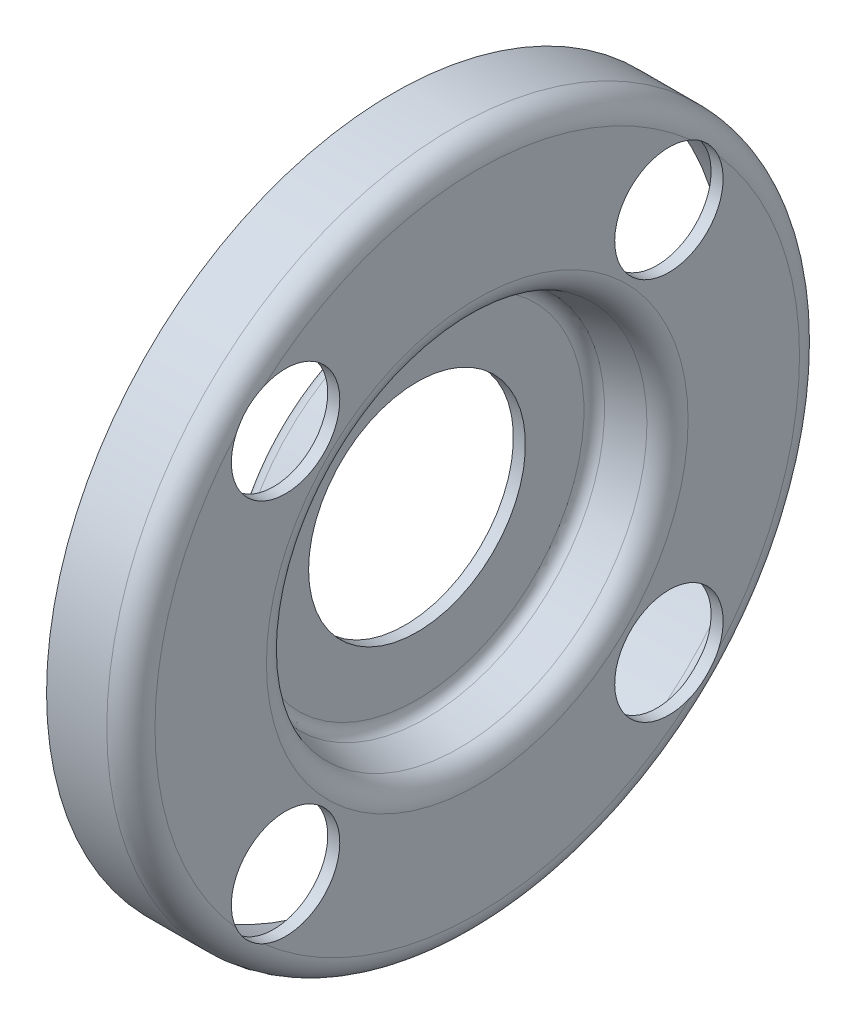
ISO-10303-21;
HEADER;
FILE_DESCRIPTION(('STEP AP214'),'2;1');
FILE_NAME('part.step','',(''),(''),'','','');
FILE_SCHEMA(('AUTOMOTIVE_DESIGN { 1 0 10303 214 1 1 1 1 }'));
ENDSEC;
DATA;
#1=APPLICATION_CONTEXT('core data for automotive mechanical design processes');
#2=APPLICATION_PROTOCOL_DEFINITION('international standard','automotive_design',2000,#1);
#3=PRODUCT_CONTEXT('',#1,'mechanical');
#4=PRODUCT('Part','Part','',(#3));
#5=PRODUCT_RELATED_PRODUCT_CATEGORY('part','',(#4));
#6=PRODUCT_DEFINITION_FORMATION('','',#4);
#7=PRODUCT_DEFINITION_CONTEXT('part definition',#1,'design');
#8=PRODUCT_DEFINITION('design','',#6,#7);
#9=PRODUCT_DEFINITION_SHAPE('','',#8);
#10=(LENGTH_UNIT() NAMED_UNIT(*) SI_UNIT(.MILLI.,.METRE.));
#11=(NAMED_UNIT(*) PLANE_ANGLE_UNIT() SI_UNIT($,.RADIAN.));
#12=(NAMED_UNIT(*) SI_UNIT($,.STERADIAN.) SOLID_ANGLE_UNIT());
#13=UNCERTAINTY_MEASURE_WITH_UNIT(LENGTH_MEASURE(1.E-05),#10,'distance_accuracy_value','');
#14=(GEOMETRIC_REPRESENTATION_CONTEXT(3) GLOBAL_UNCERTAINTY_ASSIGNED_CONTEXT((#13)) GLOBAL_UNIT_ASSIGNED_CONTEXT((#10,
#11,#12)) REPRESENTATION_CONTEXT('',''));
#15=CARTESIAN_POINT('',(0.,0.,0.));
#16=DIRECTION('',(0.,0.,1.));
#17=DIRECTION('',(1.,0.,0.));
#18=AXIS2_PLACEMENT_3D('',#15,#16,#17);
#19=CARTESIAN_POINT('',(8.,0.,0.));
#20=DIRECTION('',(-1.,0.,0.));
#21=DIRECTION('',(0.,0.,1.));
#22=AXIS2_PLACEMENT_3D('',#19,#20,#21);
#23=TOROIDAL_SURFACE('',#22,53.5,2.);
#24=CARTESIAN_POINT('',(8.,0.,0.));
#25=DIRECTION('',(-1.,0.,0.));
#26=DIRECTION('',(0.,0.,1.));
#27=AXIS2_PLACEMENT_3D('',#24,#25,#26);
#28=CIRCLE('',#27,55.5);
#29=CARTESIAN_POINT('',(8.,0.,55.5));
#30=VERTEX_POINT('',#29);
#31=EDGE_CURVE('E219',#30,#30,#28,.T.);
#32=ORIENTED_EDGE('',*,*,#31,.T.);
#33=EDGE_LOOP('',(#32));
#34=FACE_BOUND('',#33,.T.);
#35=CARTESIAN_POINT('',(10.,0.,0.));
#36=DIRECTION('',(-1.,0.,0.));
#37=DIRECTION('',(0.,0.,1.));
#38=AXIS2_PLACEMENT_3D('',#35,#36,#37);
#39=CIRCLE('',#38,53.5);
#40=CARTESIAN_POINT('',(10.,-35.4818472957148,40.0410853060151));
#41=VERTEX_POINT('',#40);
#42=CARTESIAN_POINT('',(10.,35.4818472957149,40.041085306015));
#43=VERTEX_POINT('',#42);
#44=EDGE_CURVE('E222',#41,#43,#39,.T.);
#45=ORIENTED_EDGE('',*,*,#44,.F.);
#46=CARTESIAN_POINT('',(7.9998,-31.4125163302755,40.8105846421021));
#47=CARTESIAN_POINT('',(8.04120240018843,-31.4124959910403,40.8105810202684));
#48=CARTESIAN_POINT('',(8.08259757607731,-31.4144936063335,40.8106741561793));
#49=CARTESIAN_POINT('',(8.16497952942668,-31.4224177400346,40.8110293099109));
#50=CARTESIAN_POINT('',(8.20596658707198,-31.4283413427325,40.8112912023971));
#51=CARTESIAN_POINT('',(8.28685430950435,-31.4439438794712,40.81195645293));
#52=CARTESIAN_POINT('',(8.32676125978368,-31.4535903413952,40.812358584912));
#53=CARTESIAN_POINT('',(8.40553299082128,-31.4764435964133,40.8132602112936));
#54=CARTESIAN_POINT('',(8.44439763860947,-31.4896508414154,40.813759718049));
#55=CARTESIAN_POINT('',(8.55880748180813,-31.534198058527,40.8153213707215));
#56=CARTESIAN_POINT('',(8.63246151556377,-31.5705223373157,40.8164497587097));
#57=CARTESIAN_POINT('',(8.77320569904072,-31.6542755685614,40.8183802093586));
#58=CARTESIAN_POINT('',(8.84028149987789,-31.7017280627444,40.8191815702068));
#59=CARTESIAN_POINT('',(8.99188922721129,-31.825639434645,40.8200894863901));
#60=CARTESIAN_POINT('',(9.07306541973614,-31.9062021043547,40.8198046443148));
#61=CARTESIAN_POINT('',(9.22164169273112,-32.0790800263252,40.8164862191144));
#62=CARTESIAN_POINT('',(9.28901565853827,-32.171417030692,40.8134474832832));
#63=CARTESIAN_POINT('',(9.39640242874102,-32.3404908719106,40.8050287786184));
#64=CARTESIAN_POINT('',(9.43909253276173,-32.415604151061,40.80039219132));
#65=CARTESIAN_POINT('',(9.51797744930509,-32.5690355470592,40.7888948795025));
#66=CARTESIAN_POINT('',(9.55416882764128,-32.6473553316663,40.7820329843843));
#67=CARTESIAN_POINT('',(9.62077644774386,-32.8062609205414,40.7659380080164));
#68=CARTESIAN_POINT('',(9.65118580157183,-32.8868492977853,40.7567021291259));
#69=CARTESIAN_POINT('',(9.70686576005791,-33.0494822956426,40.7357810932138));
#70=CARTESIAN_POINT('',(9.73213447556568,-33.1315274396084,40.724095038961));
#71=CARTESIAN_POINT('',(9.79453171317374,-33.3551657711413,40.6890240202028));
#72=CARTESIAN_POINT('',(9.82731065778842,-33.4976030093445,40.6632303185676));
#73=CARTESIAN_POINT('',(9.8823933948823,-33.7829917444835,40.6042905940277));
#74=CARTESIAN_POINT('',(9.90468975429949,-33.9259435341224,40.5711393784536));
#75=CARTESIAN_POINT('',(9.94108579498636,-34.2112960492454,40.4975079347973));
#76=CARTESIAN_POINT('',(9.95516826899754,-34.353695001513,40.4570125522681));
#77=CARTESIAN_POINT('',(9.97695171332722,-34.6367719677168,40.3688810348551));
#78=CARTESIAN_POINT('',(9.98465069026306,-34.7774494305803,40.3212426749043));
#79=CARTESIAN_POINT('',(9.99857099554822,-35.143128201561,40.1872129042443));
#80=CARTESIAN_POINT('',(10.0009015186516,-35.3662096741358,40.0951348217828));
#81=CARTESIAN_POINT('',(9.99853308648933,-35.8042709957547,39.8933589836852));
#82=CARTESIAN_POINT('',(9.99383016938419,-36.019246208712,39.7836513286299));
#83=CARTESIAN_POINT('',(9.98171978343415,-36.4395389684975,39.5474265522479));
#84=CARTESIAN_POINT('',(9.97431357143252,-36.6448609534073,39.4209172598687));
#85=CARTESIAN_POINT('',(9.96015926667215,-37.044666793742,39.1518494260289));
#86=CARTESIAN_POINT('',(9.9534110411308,-37.2391528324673,39.0092941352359));
#87=CARTESIAN_POINT('',(9.94279461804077,-37.6204727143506,38.7055173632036));
#88=CARTESIAN_POINT('',(9.93899654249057,-37.8070260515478,38.5439407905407));
#89=CARTESIAN_POINT('',(9.93578304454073,-38.1662663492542,38.2059817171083));
#90=CARTESIAN_POINT('',(9.93636789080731,-38.3389524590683,38.0295983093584));
#91=CARTESIAN_POINT('',(9.94174015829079,-38.6695970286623,37.6628732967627));
#92=CARTESIAN_POINT('',(9.94653704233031,-38.8275214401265,37.4725011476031));
#93=CARTESIAN_POINT('',(9.95874725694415,-39.127122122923,37.0794793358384));
#94=CARTESIAN_POINT('',(9.96616042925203,-39.2687993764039,36.8768304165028));
#95=CARTESIAN_POINT('',(9.98087494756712,-39.5371688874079,36.4571908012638));
#96=CARTESIAN_POINT('',(9.98817252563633,-39.663580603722,36.2400207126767));
#97=CARTESIAN_POINT('',(9.99840835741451,-39.8979348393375,35.7955967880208));
#98=CARTESIAN_POINT('',(10.0013441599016,-40.0058669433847,35.5683373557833));
#99=CARTESIAN_POINT('',(9.99844391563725,-40.1529181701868,35.2219912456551));
#100=CARTESIAN_POINT('',(9.99627479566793,-40.1993596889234,35.1059400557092));
#101=CARTESIAN_POINT('',(9.98871588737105,-40.2873353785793,34.8721034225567));
#102=CARTESIAN_POINT('',(9.98332670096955,-40.328870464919,34.7543183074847));
#103=CARTESIAN_POINT('',(9.96843671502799,-40.4068853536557,34.5175037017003));
#104=CARTESIAN_POINT('',(9.95894119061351,-40.4433715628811,34.3984759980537));
#105=CARTESIAN_POINT('',(9.9348016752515,-40.5112472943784,34.1595160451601));
#106=CARTESIAN_POINT('',(9.92015958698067,-40.5426386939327,34.0395841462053));
#107=CARTESIAN_POINT('',(9.89139583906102,-40.589134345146,33.8457902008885));
#108=CARTESIAN_POINT('',(9.87925557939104,-40.605847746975,33.7720174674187));
#109=CARTESIAN_POINT('',(9.85225647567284,-40.637318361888,33.6245627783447));
#110=CARTESIAN_POINT('',(9.83739785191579,-40.6520757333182,33.5508808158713));
#111=CARTESIAN_POINT('',(9.78819841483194,-40.6934254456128,33.3301769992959));
#112=CARTESIAN_POINT('',(9.74924343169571,-40.7170791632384,33.1835651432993));
#113=CARTESIAN_POINT('',(9.65548814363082,-40.756785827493,32.8931255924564));
#114=CARTESIAN_POINT('',(9.60057385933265,-40.7727818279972,32.7493261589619));
#115=CARTESIAN_POINT('',(9.47110558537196,-40.7973700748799,32.4700558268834));
#116=CARTESIAN_POINT('',(9.39658438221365,-40.8059745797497,32.3345714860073));
#117=CARTESIAN_POINT('',(9.25295565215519,-40.8151389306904,32.1219221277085));
#118=CARTESIAN_POINT('',(9.19039947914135,-40.8174281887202,32.0404261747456));
#119=CARTESIAN_POINT('',(9.05400170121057,-40.8198752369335,31.8873550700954));
#120=CARTESIAN_POINT('',(8.98017110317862,-40.8200350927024,31.8157703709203));
#121=CARTESIAN_POINT('',(8.83433719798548,-40.819132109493,31.6971239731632));
#122=CARTESIAN_POINT('',(8.76404815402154,-40.8182669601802,31.6479646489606));
#123=CARTESIAN_POINT('',(8.61634184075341,-40.816213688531,31.5619465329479));
#124=CARTESIAN_POINT('',(8.53894082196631,-40.8150262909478,31.5250605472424));
#125=CARTESIAN_POINT('',(8.42236616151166,-40.8134760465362,31.4820728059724));
#126=CARTESIAN_POINT('',(8.38527787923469,-40.8130157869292,31.4701353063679));
#127=CARTESIAN_POINT('',(8.31020413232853,-40.8121896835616,31.449498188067));
#128=CARTESIAN_POINT('',(8.2722188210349,-40.8118238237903,31.4407980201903));
#129=CARTESIAN_POINT('',(8.19534020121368,-40.8112208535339,31.4267447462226));
#130=CARTESIAN_POINT('',(8.1564422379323,-40.8109847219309,31.4214170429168));
#131=CARTESIAN_POINT('',(8.0782982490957,-40.8106650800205,31.4142930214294));
#132=CARTESIAN_POINT('',(8.03905200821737,-40.8105816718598,31.4124990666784));
#133=CARTESIAN_POINT('',(7.9998,-40.8105846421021,31.4125163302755));
#134=B_SPLINE_CURVE_WITH_KNOTS('',3,(#46,#47,#48,#49,#50,#51,#52,#53,#54,#55,#56,#57,#58,#59,
#60,#61,#62,#63,#64,#65,#66,#67,#68,#69,#70,#71,#72,#73,#74,#75,#76,#77,#78,#79,#80,#81,#82,#83,
#84,#85,#86,#87,#88,#89,#90,#91,#92,#93,#94,#95,#96,#97,#98,#99,#100,#101,#102,#103,#104,#105,
#106,#107,#108,#109,#110,#111,#112,#113,#114,#115,#116,#117,#118,#119,#120,#121,#122,#123,#124,
#125,#126,#127,#128,#129,#130,#131,#132,#133),.UNSPECIFIED.,.F.,.F.,(4,2,2,2,2,2,2,2,2,2,2,2,2,
2,2,2,2,2,2,2,2,2,2,2,2,2,2,2,2,2,2,2,2,2,2,2,2,2,2,2,2,2,2,4),(0.,0.124146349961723,
0.248200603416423,0.371196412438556,0.494207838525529,0.73934682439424,0.985009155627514,
1.32620717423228,1.66804491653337,1.92726173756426,2.18661513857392,2.44627558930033,
2.70603129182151,3.1505599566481,3.59540335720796,4.04117534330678,4.48708647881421,
5.21007577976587,5.93347248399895,6.65653328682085,7.37944787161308,8.1190600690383,
8.85871760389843,9.60004112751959,10.3413198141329,11.0946300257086,11.8483634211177,
12.223296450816,12.5981594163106,12.9725422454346,13.3467868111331,13.5765496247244,
13.8062938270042,14.2659928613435,14.7290592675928,15.1913562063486,15.4987650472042,
15.8058756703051,16.0622350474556,16.3180225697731,16.4347991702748,16.5515559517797,
16.6691820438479,16.7868867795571),.UNSPECIFIED.);
#135=CARTESIAN_POINT('',(10.,-40.0410853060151,35.4818472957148));
#136=VERTEX_POINT('',#135);
#137=EDGE_CURVE('E50',#41,#136,#134,.T.);
#138=ORIENTED_EDGE('',*,*,#137,.T.);
#139=CARTESIAN_POINT('',(10.,-40.0410853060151,-35.4818472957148));
#140=VERTEX_POINT('',#139);
#141=EDGE_CURVE('E220',#140,#136,#39,.T.);
#142=ORIENTED_EDGE('',*,*,#141,.F.);
#143=CARTESIAN_POINT('',(7.9998,-40.8105846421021,-31.4125163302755));
#144=CARTESIAN_POINT('',(8.04120240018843,-40.8105810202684,-31.4124959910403));
#145=CARTESIAN_POINT('',(8.08259757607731,-40.8106741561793,-31.4144936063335));
#146=CARTESIAN_POINT('',(8.16497952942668,-40.8110293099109,-31.4224177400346));
#147=CARTESIAN_POINT('',(8.20596658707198,-40.8112912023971,-31.4283413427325));
#148=CARTESIAN_POINT('',(8.28685430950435,-40.81195645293,-31.4439438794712));
#149=CARTESIAN_POINT('',(8.32676125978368,-40.812358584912,-31.4535903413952));
#150=CARTESIAN_POINT('',(8.40553299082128,-40.8132602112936,-31.4764435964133));
#151=CARTESIAN_POINT('',(8.44439763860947,-40.813759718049,-31.4896508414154));
#152=CARTESIAN_POINT('',(8.55880748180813,-40.8153213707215,-31.5341980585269));
#153=CARTESIAN_POINT('',(8.63246151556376,-40.8164497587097,-31.5705223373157));
#154=CARTESIAN_POINT('',(8.77320569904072,-40.8183802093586,-31.6542755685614));
#155=CARTESIAN_POINT('',(8.84028149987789,-40.8191815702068,-31.7017280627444));
#156=CARTESIAN_POINT('',(8.99188922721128,-40.8200894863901,-31.825639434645));
#157=CARTESIAN_POINT('',(9.07306541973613,-40.8198046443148,-31.9062021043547));
#158=CARTESIAN_POINT('',(9.22164169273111,-40.8164862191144,-32.0790800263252));
#159=CARTESIAN_POINT('',(9.28901565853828,-40.8134474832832,-32.1714170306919));
#160=CARTESIAN_POINT('',(9.39640242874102,-40.8050287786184,-32.3404908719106));
#161=CARTESIAN_POINT('',(9.43909253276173,-40.80039219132,-32.415604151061));
#162=CARTESIAN_POINT('',(9.51797744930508,-40.7888948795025,-32.5690355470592));
#163=CARTESIAN_POINT('',(9.55416882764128,-40.7820329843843,-32.6473553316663));
#164=CARTESIAN_POINT('',(9.62077644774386,-40.7659380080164,-32.8062609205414));
#165=CARTESIAN_POINT('',(9.65118580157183,-40.756702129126,-32.8868492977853));
#166=CARTESIAN_POINT('',(9.70686576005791,-40.7357810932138,-33.0494822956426));
#167=CARTESIAN_POINT('',(9.73213447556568,-40.724095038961,-33.1315274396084));
#168=CARTESIAN_POINT('',(9.79453171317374,-40.6890240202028,-33.3551657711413));
#169=CARTESIAN_POINT('',(9.82731065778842,-40.6632303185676,-33.4976030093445));
#170=CARTESIAN_POINT('',(9.8823933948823,-40.6042905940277,-33.7829917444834));
#171=CARTESIAN_POINT('',(9.90468975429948,-40.5711393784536,-33.9259435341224));
#172=CARTESIAN_POINT('',(9.94108579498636,-40.4975079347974,-34.2112960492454));
#173=CARTESIAN_POINT('',(9.95516826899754,-40.4570125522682,-34.353695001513));
#174=CARTESIAN_POINT('',(9.97695171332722,-40.3688810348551,-34.6367719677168));
#175=CARTESIAN_POINT('',(9.98465069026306,-40.3212426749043,-34.7774494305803));
#176=CARTESIAN_POINT('',(9.99857099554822,-40.1872129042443,-35.143128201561));
#177=CARTESIAN_POINT('',(10.0009015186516,-40.0951348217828,-35.3662096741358));
#178=CARTESIAN_POINT('',(9.99853308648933,-39.8933589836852,-35.8042709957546));
#179=CARTESIAN_POINT('',(9.99383016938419,-39.78365132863,-36.0192462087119));
#180=CARTESIAN_POINT('',(9.98171978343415,-39.547426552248,-36.4395389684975));
#181=CARTESIAN_POINT('',(9.97431357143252,-39.4209172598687,-36.6448609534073));
#182=CARTESIAN_POINT('',(9.96015926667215,-39.1518494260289,-37.044666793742));
#183=CARTESIAN_POINT('',(9.9534110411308,-39.0092941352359,-37.2391528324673));
#184=CARTESIAN_POINT('',(9.94279461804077,-38.7055173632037,-37.6204727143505));
#185=CARTESIAN_POINT('',(9.93899654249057,-38.5439407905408,-37.8070260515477));
#186=CARTESIAN_POINT('',(9.93578304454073,-38.2059817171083,-38.1662663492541));
#187=CARTESIAN_POINT('',(9.93636789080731,-38.0295983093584,-38.3389524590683));
#188=CARTESIAN_POINT('',(9.94174015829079,-37.6628732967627,-38.6695970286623));
#189=CARTESIAN_POINT('',(9.9465370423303,-37.4725011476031,-38.8275214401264));
#190=CARTESIAN_POINT('',(9.95874725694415,-37.0794793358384,-39.127122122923));
#191=CARTESIAN_POINT('',(9.96616042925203,-36.8768304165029,-39.2687993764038));
#192=CARTESIAN_POINT('',(9.98087494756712,-36.4571908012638,-39.5371688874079));
#193=CARTESIAN_POINT('',(9.98817252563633,-36.2400207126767,-39.663580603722));
#194=CARTESIAN_POINT('',(9.99840835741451,-35.7955967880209,-39.8979348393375));
#195=CARTESIAN_POINT('',(10.0013441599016,-35.5683373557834,-40.0058669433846));
#196=CARTESIAN_POINT('',(9.99844391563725,-35.2219912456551,-40.1529181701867));
#197=CARTESIAN_POINT('',(9.99627479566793,-35.1059400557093,-40.1993596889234));
#198=CARTESIAN_POINT('',(9.98871588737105,-34.8721034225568,-40.2873353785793));
#199=CARTESIAN_POINT('',(9.98332670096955,-34.7543183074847,-40.3288704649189));
#200=CARTESIAN_POINT('',(9.968436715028,-34.5175037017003,-40.4068853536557));
#201=CARTESIAN_POINT('',(9.95894119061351,-34.3984759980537,-40.4433715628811));
#202=CARTESIAN_POINT('',(9.93480167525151,-34.1595160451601,-40.5112472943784));
#203=CARTESIAN_POINT('',(9.92015958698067,-34.0395841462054,-40.5426386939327));
#204=CARTESIAN_POINT('',(9.89139583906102,-33.8457902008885,-40.589134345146));
#205=CARTESIAN_POINT('',(9.87925557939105,-33.7720174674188,-40.605847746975));
#206=CARTESIAN_POINT('',(9.85225647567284,-33.6245627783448,-40.637318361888));
#207=CARTESIAN_POINT('',(9.8373978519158,-33.5508808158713,-40.6520757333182));
#208=CARTESIAN_POINT('',(9.78819841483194,-33.3301769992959,-40.6934254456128));
#209=CARTESIAN_POINT('',(9.74924343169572,-33.1835651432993,-40.7170791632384));
#210=CARTESIAN_POINT('',(9.65548814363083,-32.8931255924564,-40.756785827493));
#211=CARTESIAN_POINT('',(9.60057385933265,-32.7493261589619,-40.7727818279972));
#212=CARTESIAN_POINT('',(9.47110558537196,-32.4700558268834,-40.7973700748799));
#213=CARTESIAN_POINT('',(9.39658438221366,-32.3345714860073,-40.8059745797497));
#214=CARTESIAN_POINT('',(9.2529556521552,-32.1219221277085,-40.8151389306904));
#215=CARTESIAN_POINT('',(9.19039947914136,-32.0404261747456,-40.8174281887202));
#216=CARTESIAN_POINT('',(9.05400170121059,-31.8873550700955,-40.8198752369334));
#217=CARTESIAN_POINT('',(8.98017110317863,-31.8157703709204,-40.8200350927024));
#218=CARTESIAN_POINT('',(8.83433719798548,-31.6971239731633,-40.819132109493));
#219=CARTESIAN_POINT('',(8.76404815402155,-31.6479646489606,-40.8182669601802));
#220=CARTESIAN_POINT('',(8.61634184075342,-31.5619465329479,-40.816213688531));
#221=CARTESIAN_POINT('',(8.53894082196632,-31.5250605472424,-40.8150262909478));
#222=CARTESIAN_POINT('',(8.42236616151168,-31.4820728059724,-40.8134760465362));
#223=CARTESIAN_POINT('',(8.3852778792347,-31.4701353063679,-40.8130157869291));
#224=CARTESIAN_POINT('',(8.31020413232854,-31.449498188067,-40.8121896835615));
#225=CARTESIAN_POINT('',(8.27221882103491,-31.4407980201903,-40.8118238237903));
#226=CARTESIAN_POINT('',(8.19534020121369,-31.4267447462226,-40.8112208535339));
#227=CARTESIAN_POINT('',(8.15644223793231,-31.4214170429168,-40.8109847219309));
#228=CARTESIAN_POINT('',(8.07829824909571,-31.4142930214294,-40.8106650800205));
#229=CARTESIAN_POINT('',(8.03905200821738,-31.4124990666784,-40.8105816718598));
#230=CARTESIAN_POINT('',(7.99980000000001,-31.4125163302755,-40.8105846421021));
#231=B_SPLINE_CURVE_WITH_KNOTS('',3,(#143,#144,#145,#146,#147,#148,#149,#150,#151,#152,#153,
#154,#155,#156,#157,#158,#159,#160,#161,#162,#163,#164,#165,#166,#167,#168,#169,#170,#171,#172,
#173,#174,#175,#176,#177,#178,#179,#180,#181,#182,#183,#184,#185,#186,#187,#188,#189,#190,#191,
#192,#193,#194,#195,#196,#197,#198,#199,#200,#201,#202,#203,#204,#205,#206,#207,#208,#209,#210,
#211,#212,#213,#214,#215,#216,#217,#218,#219,#220,#221,#222,#223,#224,#225,#226,#227,#228,#229,
#230),.UNSPECIFIED.,.F.,.F.,(4,2,2,2,2,2,2,2,2,2,2,2,2,2,2,2,2,2,2,2,2,2,2,2,2,2,2,2,2,2,2,2,2,
2,2,2,2,2,2,2,2,2,2,4),(0.,0.124146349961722,0.248200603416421,0.371196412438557,
0.494207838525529,0.73934682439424,0.98500915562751,1.32620717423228,1.66804491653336,
1.92726173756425,2.18661513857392,2.44627558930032,2.7060312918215,3.15055995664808,
3.59540335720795,4.04117534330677,4.4870864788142,5.21007577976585,5.93347248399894,
6.65653328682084,7.37944787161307,8.11906006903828,8.8587176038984,9.60004112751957,
10.3413198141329,11.0946300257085,11.8483634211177,12.2232964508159,12.5981594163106,
12.9725422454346,13.3467868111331,13.5765496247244,13.8062938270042,14.2659928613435,
14.7290592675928,15.1913562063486,15.4987650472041,15.8058756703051,16.0622350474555,
16.3180225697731,16.4347991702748,16.5515559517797,16.6691820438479,16.7868867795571),.UNSPECIFIED.);
#232=CARTESIAN_POINT('',(10.,-35.4818472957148,-40.0410853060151));
#233=VERTEX_POINT('',#232);
#234=EDGE_CURVE('E181',#140,#233,#231,.T.);
#235=ORIENTED_EDGE('',*,*,#234,.T.);
#236=CARTESIAN_POINT('',(10.,35.4818472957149,-40.041085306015));
#237=VERTEX_POINT('',#236);
#238=EDGE_CURVE('E213',#237,#233,#39,.T.);
#239=ORIENTED_EDGE('',*,*,#238,.F.);
#240=CARTESIAN_POINT('',(7.9998,31.4125163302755,-40.8105846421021));
#241=CARTESIAN_POINT('',(8.04120240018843,31.4124959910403,-40.8105810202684));
#242=CARTESIAN_POINT('',(8.08259757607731,31.4144936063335,-40.8106741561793));
#243=CARTESIAN_POINT('',(8.16497952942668,31.4224177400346,-40.8110293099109));
#244=CARTESIAN_POINT('',(8.20596658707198,31.4283413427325,-40.8112912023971));
#245=CARTESIAN_POINT('',(8.28685430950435,31.4439438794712,-40.81195645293));
#246=CARTESIAN_POINT('',(8.32676125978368,31.4535903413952,-40.812358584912));
#247=CARTESIAN_POINT('',(8.40553299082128,31.4764435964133,-40.8132602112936));
#248=CARTESIAN_POINT('',(8.44439763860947,31.4896508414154,-40.813759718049));
#249=CARTESIAN_POINT('',(8.55880748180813,31.534198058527,-40.8153213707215));
#250=CARTESIAN_POINT('',(8.63246151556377,31.5705223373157,-40.8164497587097));
#251=CARTESIAN_POINT('',(8.77320569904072,31.6542755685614,-40.8183802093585));
#252=CARTESIAN_POINT('',(8.84028149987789,31.7017280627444,-40.8191815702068));
#253=CARTESIAN_POINT('',(8.99188922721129,31.825639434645,-40.8200894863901));
#254=CARTESIAN_POINT('',(9.07306541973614,31.9062021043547,-40.8198046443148));
#255=CARTESIAN_POINT('',(9.22164169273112,32.0790800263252,-40.8164862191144));
#256=CARTESIAN_POINT('',(9.28901565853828,32.171417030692,-40.8134474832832));
#257=CARTESIAN_POINT('',(9.39640242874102,32.3404908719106,-40.8050287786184));
#258=CARTESIAN_POINT('',(9.43909253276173,32.415604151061,-40.80039219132));
#259=CARTESIAN_POINT('',(9.51797744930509,32.5690355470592,-40.7888948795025));
#260=CARTESIAN_POINT('',(9.55416882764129,32.6473553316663,-40.7820329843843));
#261=CARTESIAN_POINT('',(9.62077644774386,32.8062609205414,-40.7659380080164));
#262=CARTESIAN_POINT('',(9.65118580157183,32.8868492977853,-40.7567021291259));
#263=CARTESIAN_POINT('',(9.70686576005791,33.0494822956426,-40.7357810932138));
#264=CARTESIAN_POINT('',(9.73213447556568,33.1315274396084,-40.724095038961));
#265=CARTESIAN_POINT('',(9.79453171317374,33.3551657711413,-40.6890240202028));
#266=CARTESIAN_POINT('',(9.82731065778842,33.4976030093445,-40.6632303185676));
#267=CARTESIAN_POINT('',(9.8823933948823,33.7829917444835,-40.6042905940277));
#268=CARTESIAN_POINT('',(9.90468975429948,33.9259435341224,-40.5711393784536));
#269=CARTESIAN_POINT('',(9.94108579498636,34.2112960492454,-40.4975079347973));
#270=CARTESIAN_POINT('',(9.95516826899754,34.353695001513,-40.4570125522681));
#271=CARTESIAN_POINT('',(9.97695171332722,34.6367719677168,-40.3688810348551));
#272=CARTESIAN_POINT('',(9.98465069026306,34.7774494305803,-40.3212426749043));
#273=CARTESIAN_POINT('',(9.99857099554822,35.143128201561,-40.1872129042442));
#274=CARTESIAN_POINT('',(10.0009015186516,35.3662096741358,-40.0951348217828));
#275=CARTESIAN_POINT('',(9.99853308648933,35.8042709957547,-39.8933589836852));
#276=CARTESIAN_POINT('',(9.99383016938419,36.019246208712,-39.7836513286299));
#277=CARTESIAN_POINT('',(9.98171978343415,36.4395389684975,-39.5474265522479));
#278=CARTESIAN_POINT('',(9.97431357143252,36.6448609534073,-39.4209172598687));
#279=CARTESIAN_POINT('',(9.96015926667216,37.044666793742,-39.1518494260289));
#280=CARTESIAN_POINT('',(9.9534110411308,37.2391528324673,-39.0092941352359));
#281=CARTESIAN_POINT('',(9.94279461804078,37.6204727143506,-38.7055173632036));
#282=CARTESIAN_POINT('',(9.93899654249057,37.8070260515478,-38.5439407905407));
#283=CARTESIAN_POINT('',(9.93578304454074,38.1662663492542,-38.2059817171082));
#284=CARTESIAN_POINT('',(9.93636789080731,38.3389524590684,-38.0295983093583));
#285=CARTESIAN_POINT('',(9.9417401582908,38.6695970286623,-37.6628732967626));
#286=CARTESIAN_POINT('',(9.94653704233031,38.8275214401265,-37.4725011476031));
#287=CARTESIAN_POINT('',(9.95874725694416,39.127122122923,-37.0794793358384));
#288=CARTESIAN_POINT('',(9.96616042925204,39.2687993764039,-36.8768304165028));
#289=CARTESIAN_POINT('',(9.98087494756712,39.5371688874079,-36.4571908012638));
#290=CARTESIAN_POINT('',(9.98817252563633,39.663580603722,-36.2400207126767));
#291=CARTESIAN_POINT('',(9.99840835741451,39.8979348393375,-35.7955967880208));
#292=CARTESIAN_POINT('',(10.0013441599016,40.0058669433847,-35.5683373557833));
#293=CARTESIAN_POINT('',(9.99844391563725,40.1529181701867,-35.221991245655));
#294=CARTESIAN_POINT('',(9.99627479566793,40.1993596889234,-35.1059400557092));
#295=CARTESIAN_POINT('',(9.98871588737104,40.2873353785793,-34.8721034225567));
#296=CARTESIAN_POINT('',(9.98332670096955,40.328870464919,-34.7543183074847));
#297=CARTESIAN_POINT('',(9.96843671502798,40.4068853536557,-34.5175037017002));
#298=CARTESIAN_POINT('',(9.9589411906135,40.4433715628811,-34.3984759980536));
#299=CARTESIAN_POINT('',(9.93480167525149,40.5112472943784,-34.15951604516));
#300=CARTESIAN_POINT('',(9.92015958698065,40.5426386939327,-34.0395841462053));
#301=CARTESIAN_POINT('',(9.891395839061,40.589134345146,-33.8457902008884));
#302=CARTESIAN_POINT('',(9.87925557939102,40.6058477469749,-33.7720174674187));
#303=CARTESIAN_POINT('',(9.85225647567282,40.637318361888,-33.6245627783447));
#304=CARTESIAN_POINT('',(9.83739785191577,40.6520757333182,-33.5508808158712));
#305=CARTESIAN_POINT('',(9.78819841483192,40.6934254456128,-33.3301769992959));
#306=CARTESIAN_POINT('',(9.74924343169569,40.7170791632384,-33.1835651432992));
#307=CARTESIAN_POINT('',(9.65548814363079,40.756785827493,-32.8931255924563));
#308=CARTESIAN_POINT('',(9.60057385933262,40.7727818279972,-32.7493261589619));
#309=CARTESIAN_POINT('',(9.47110558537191,40.7973700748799,-32.4700558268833));
#310=CARTESIAN_POINT('',(9.39658438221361,40.8059745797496,-32.3345714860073));
#311=CARTESIAN_POINT('',(9.25295565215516,40.8151389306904,-32.1219221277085));
#312=CARTESIAN_POINT('',(9.19039947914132,40.8174281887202,-32.0404261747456));
#313=CARTESIAN_POINT('',(9.05400170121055,40.8198752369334,-31.8873550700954));
#314=CARTESIAN_POINT('',(8.9801711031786,40.8200350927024,-31.8157703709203));
#315=CARTESIAN_POINT('',(8.83433719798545,40.8191321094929,-31.6971239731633));
#316=CARTESIAN_POINT('',(8.76404815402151,40.8182669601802,-31.6479646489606));
#317=CARTESIAN_POINT('',(8.61634184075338,40.816213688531,-31.561946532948));
#318=CARTESIAN_POINT('',(8.53894082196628,40.8150262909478,-31.5250605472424));
#319=CARTESIAN_POINT('',(8.42236616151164,40.8134760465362,-31.4820728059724));
#320=CARTESIAN_POINT('',(8.38527787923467,40.8130157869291,-31.470135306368));
#321=CARTESIAN_POINT('',(8.31020413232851,40.8121896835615,-31.449498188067));
#322=CARTESIAN_POINT('',(8.27221882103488,40.8118238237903,-31.4407980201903));
#323=CARTESIAN_POINT('',(8.19534020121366,40.8112208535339,-31.4267447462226));
#324=CARTESIAN_POINT('',(8.15644223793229,40.8109847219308,-31.4214170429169));
#325=CARTESIAN_POINT('',(8.07829824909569,40.8106650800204,-31.4142930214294));
#326=CARTESIAN_POINT('',(8.03905200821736,40.8105816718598,-31.4124990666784));
#327=CARTESIAN_POINT('',(7.9998,40.810584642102,-31.4125163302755));
#328=B_SPLINE_CURVE_WITH_KNOTS('',3,(#240,#241,#242,#243,#244,#245,#246,#247,#248,#249,#250,
#251,#252,#253,#254,#255,#256,#257,#258,#259,#260,#261,#262,#263,#264,#265,#266,#267,#268,#269,
#270,#271,#272,#273,#274,#275,#276,#277,#278,#279,#280,#281,#282,#283,#284,#285,#286,#287,#288,
#289,#290,#291,#292,#293,#294,#295,#296,#297,#298,#299,#300,#301,#302,#303,#304,#305,#306,#307,
#308,#309,#310,#311,#312,#313,#314,#315,#316,#317,#318,#319,#320,#321,#322,#323,#324,#325,#326,
#327),.UNSPECIFIED.,.F.,.F.,(4,2,2,2,2,2,2,2,2,2,2,2,2,2,2,2,2,2,2,2,2,2,2,2,2,2,2,2,2,2,2,2,2,
2,2,2,2,2,2,2,2,2,2,4),(0.,0.124146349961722,0.248200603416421,0.371196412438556,
0.494207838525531,0.739346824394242,0.985009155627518,1.32620717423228,1.66804491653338,
1.92726173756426,2.18661513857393,2.44627558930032,2.70603129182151,3.15055995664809,
3.59540335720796,4.04117534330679,4.48708647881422,5.21007577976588,5.93347248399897,
6.65653328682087,7.37944787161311,8.11906006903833,8.85871760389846,9.60004112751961,
10.3413198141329,11.0946300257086,11.8483634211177,12.223296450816,12.5981594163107,
12.9725422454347,13.3467868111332,13.5765496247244,13.8062938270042,14.2659928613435,
14.7290592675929,15.1913562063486,15.4987650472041,15.8058756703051,16.0622350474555,
16.3180225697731,16.4347991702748,16.5515559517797,16.6691820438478,16.7868867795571),.UNSPECIFIED.);
#329=CARTESIAN_POINT('',(10.,40.041085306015,-35.4818472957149));
#330=VERTEX_POINT('',#329);
#331=EDGE_CURVE('E125',#237,#330,#328,.T.);
#332=ORIENTED_EDGE('',*,*,#331,.T.);
#333=CARTESIAN_POINT('',(10.,40.041085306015,35.4818472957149));
#334=VERTEX_POINT('',#333);
#335=EDGE_CURVE('E215',#334,#330,#39,.T.);
#336=ORIENTED_EDGE('',*,*,#335,.F.);
#337=CARTESIAN_POINT('',(7.9998,40.810584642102,31.4125163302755));
#338=CARTESIAN_POINT('',(8.04120240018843,40.8105810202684,31.4124959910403));
#339=CARTESIAN_POINT('',(8.08259757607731,40.8106741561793,31.4144936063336));
#340=CARTESIAN_POINT('',(8.16497952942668,40.8110293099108,31.4224177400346));
#341=CARTESIAN_POINT('',(8.20596658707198,40.8112912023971,31.4283413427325));
#342=CARTESIAN_POINT('',(8.28685430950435,40.8119564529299,31.4439438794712));
#343=CARTESIAN_POINT('',(8.32676125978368,40.812358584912,31.4535903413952));
#344=CARTESIAN_POINT('',(8.40553299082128,40.8132602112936,31.4764435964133));
#345=CARTESIAN_POINT('',(8.44439763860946,40.813759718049,31.4896508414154));
#346=CARTESIAN_POINT('',(8.55880748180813,40.8153213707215,31.534198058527));
#347=CARTESIAN_POINT('',(8.63246151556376,40.8164497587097,31.5705223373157));
#348=CARTESIAN_POINT('',(8.77320569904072,40.8183802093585,31.6542755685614));
#349=CARTESIAN_POINT('',(8.84028149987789,40.8191815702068,31.7017280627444));
#350=CARTESIAN_POINT('',(8.99188922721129,40.8200894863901,31.825639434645));
#351=CARTESIAN_POINT('',(9.07306541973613,40.8198046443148,31.9062021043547));
#352=CARTESIAN_POINT('',(9.22164169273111,40.8164862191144,32.0790800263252));
#353=CARTESIAN_POINT('',(9.28901565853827,40.8134474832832,32.171417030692));
#354=CARTESIAN_POINT('',(9.39640242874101,40.8050287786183,32.3404908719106));
#355=CARTESIAN_POINT('',(9.43909253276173,40.80039219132,32.415604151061));
#356=CARTESIAN_POINT('',(9.51797744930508,40.7888948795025,32.5690355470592));
#357=CARTESIAN_POINT('',(9.55416882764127,40.7820329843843,32.6473553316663));
#358=CARTESIAN_POINT('',(9.62077644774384,40.7659380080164,32.8062609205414));
#359=CARTESIAN_POINT('',(9.65118580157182,40.7567021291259,32.8868492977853));
#360=CARTESIAN_POINT('',(9.7068657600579,40.7357810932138,33.0494822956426));
#361=CARTESIAN_POINT('',(9.73213447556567,40.724095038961,33.1315274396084));
#362=CARTESIAN_POINT('',(9.79453171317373,40.6890240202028,33.3551657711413));
#363=CARTESIAN_POINT('',(9.82731065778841,40.6632303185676,33.4976030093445));
#364=CARTESIAN_POINT('',(9.88239339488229,40.6042905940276,33.7829917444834));
#365=CARTESIAN_POINT('',(9.90468975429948,40.5711393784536,33.9259435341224));
#366=CARTESIAN_POINT('',(9.94108579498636,40.4975079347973,34.2112960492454));
#367=CARTESIAN_POINT('',(9.95516826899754,40.4570125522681,34.353695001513));
#368=CARTESIAN_POINT('',(9.97695171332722,40.3688810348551,34.6367719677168));
#369=CARTESIAN_POINT('',(9.98465069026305,40.3212426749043,34.7774494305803));
#370=CARTESIAN_POINT('',(9.99857099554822,40.1872129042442,35.143128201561));
#371=CARTESIAN_POINT('',(10.0009015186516,40.0951348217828,35.3662096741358));
#372=CARTESIAN_POINT('',(9.99853308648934,39.8933589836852,35.8042709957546));
#373=CARTESIAN_POINT('',(9.99383016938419,39.7836513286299,36.0192462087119));
#374=CARTESIAN_POINT('',(9.98171978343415,39.5474265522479,36.4395389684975));
#375=CARTESIAN_POINT('',(9.97431357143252,39.4209172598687,36.6448609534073));
#376=CARTESIAN_POINT('',(9.96015926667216,39.1518494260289,37.044666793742));
#377=CARTESIAN_POINT('',(9.9534110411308,39.0092941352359,37.2391528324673));
#378=CARTESIAN_POINT('',(9.94279461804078,38.7055173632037,37.6204727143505));
#379=CARTESIAN_POINT('',(9.93899654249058,38.5439407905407,37.8070260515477));
#380=CARTESIAN_POINT('',(9.93578304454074,38.2059817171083,38.1662663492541));
#381=CARTESIAN_POINT('',(9.93636789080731,38.0295983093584,38.3389524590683));
#382=CARTESIAN_POINT('',(9.9417401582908,37.6628732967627,38.6695970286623));
#383=CARTESIAN_POINT('',(9.94653704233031,37.4725011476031,38.8275214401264));
#384=CARTESIAN_POINT('',(9.95874725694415,37.0794793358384,39.127122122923));
#385=CARTESIAN_POINT('',(9.96616042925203,36.8768304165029,39.2687993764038));
#386=CARTESIAN_POINT('',(9.98087494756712,36.4571908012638,39.5371688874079));
#387=CARTESIAN_POINT('',(9.98817252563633,36.2400207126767,39.6635806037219));
#388=CARTESIAN_POINT('',(9.99840835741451,35.7955967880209,39.8979348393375));
#389=CARTESIAN_POINT('',(10.0013441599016,35.5683373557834,40.0058669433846));
#390=CARTESIAN_POINT('',(9.99844391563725,35.2219912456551,40.1529181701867));
#391=CARTESIAN_POINT('',(9.99627479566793,35.1059400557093,40.1993596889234));
#392=CARTESIAN_POINT('',(9.98871588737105,34.8721034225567,40.2873353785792));
#393=CARTESIAN_POINT('',(9.98332670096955,34.7543183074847,40.3288704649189));
#394=CARTESIAN_POINT('',(9.96843671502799,34.5175037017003,40.4068853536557));
#395=CARTESIAN_POINT('',(9.95894119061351,34.3984759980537,40.4433715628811));
#396=CARTESIAN_POINT('',(9.9348016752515,34.1595160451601,40.5112472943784));
#397=CARTESIAN_POINT('',(9.92015958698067,34.0395841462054,40.5426386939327));
#398=CARTESIAN_POINT('',(9.89139583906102,33.8457902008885,40.589134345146));
#399=CARTESIAN_POINT('',(9.87925557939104,33.7720174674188,40.6058477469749));
#400=CARTESIAN_POINT('',(9.85225647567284,33.6245627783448,40.637318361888));
#401=CARTESIAN_POINT('',(9.83739785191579,33.5508808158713,40.6520757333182));
#402=CARTESIAN_POINT('',(9.78819841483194,33.3301769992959,40.6934254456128));
#403=CARTESIAN_POINT('',(9.74924343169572,33.1835651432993,40.7170791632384));
#404=CARTESIAN_POINT('',(9.65548814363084,32.8931255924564,40.756785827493));
#405=CARTESIAN_POINT('',(9.60057385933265,32.7493261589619,40.7727818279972));
#406=CARTESIAN_POINT('',(9.47110558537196,32.4700558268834,40.7973700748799));
#407=CARTESIAN_POINT('',(9.39658438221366,32.3345714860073,40.8059745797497));
#408=CARTESIAN_POINT('',(9.25295565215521,32.1219221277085,40.8151389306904));
#409=CARTESIAN_POINT('',(9.19039947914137,32.0404261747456,40.8174281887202));
#410=CARTESIAN_POINT('',(9.05400170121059,31.8873550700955,40.8198752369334));
#411=CARTESIAN_POINT('',(8.98017110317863,31.8157703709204,40.8200350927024));
#412=CARTESIAN_POINT('',(8.83433719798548,31.6971239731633,40.819132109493));
#413=CARTESIAN_POINT('',(8.76404815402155,31.6479646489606,40.8182669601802));
#414=CARTESIAN_POINT('',(8.61634184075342,31.5619465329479,40.816213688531));
#415=CARTESIAN_POINT('',(8.53894082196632,31.5250605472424,40.8150262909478));
#416=CARTESIAN_POINT('',(8.42236616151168,31.4820728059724,40.8134760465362));
#417=CARTESIAN_POINT('',(8.3852778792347,31.4701353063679,40.8130157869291));
#418=CARTESIAN_POINT('',(8.31020413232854,31.449498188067,40.8121896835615));
#419=CARTESIAN_POINT('',(8.2722188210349,31.4407980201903,40.8118238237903));
#420=CARTESIAN_POINT('',(8.19534020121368,31.4267447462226,40.8112208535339));
#421=CARTESIAN_POINT('',(8.1564422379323,31.4214170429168,40.8109847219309));
#422=CARTESIAN_POINT('',(8.0782982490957,31.4142930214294,40.8106650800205));
#423=CARTESIAN_POINT('',(8.03905200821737,31.4124990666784,40.8105816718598));
#424=CARTESIAN_POINT('',(7.9998,31.4125163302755,40.8105846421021));
#425=B_SPLINE_CURVE_WITH_KNOTS('',3,(#337,#338,#339,#340,#341,#342,#343,#344,#345,#346,#347,
#348,#349,#350,#351,#352,#353,#354,#355,#356,#357,#358,#359,#360,#361,#362,#363,#364,#365,#366,
#367,#368,#369,#370,#371,#372,#373,#374,#375,#376,#377,#378,#379,#380,#381,#382,#383,#384,#385,
#386,#387,#388,#389,#390,#391,#392,#393,#394,#395,#396,#397,#398,#399,#400,#401,#402,#403,#404,
#405,#406,#407,#408,#409,#410,#411,#412,#413,#414,#415,#416,#417,#418,#419,#420,#421,#422,#423,
#424),.UNSPECIFIED.,.F.,.F.,(4,2,2,2,2,2,2,2,2,2,2,2,2,2,2,2,2,2,2,2,2,2,2,2,2,2,2,2,2,2,2,2,2,
2,2,2,2,2,2,2,2,2,2,4),(0.,0.124146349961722,0.248200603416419,0.371196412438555,
0.494207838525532,0.739346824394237,0.985009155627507,1.32620717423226,1.66804491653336,
1.92726173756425,2.1866151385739,2.4462755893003,2.70603129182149,3.15055995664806,
3.59540335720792,4.04117534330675,4.48708647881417,5.21007577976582,5.9334724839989,
6.6565332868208,7.37944787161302,8.11906006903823,8.85871760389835,9.60004112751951,
10.3413198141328,11.0946300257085,11.8483634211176,12.2232964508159,12.5981594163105,
12.9725422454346,13.346786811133,13.5765496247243,13.8062938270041,14.2659928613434,
14.7290592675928,15.1913562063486,15.4987650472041,15.8058756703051,16.0622350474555,
16.318022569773,16.4347991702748,16.5515559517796,16.6691820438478,16.7868867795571),.UNSPECIFIED.);
#426=EDGE_CURVE('E196',#334,#43,#425,.T.);
#427=ORIENTED_EDGE('',*,*,#426,.T.);
#428=EDGE_LOOP('',(#45,#138,#142,#235,#239,#332,#336,#427));
#429=FACE_BOUND('',#428,.T.);
#430=ADVANCED_FACE('F30',(#34,#429),#23,.F.);
#431=CARTESIAN_POINT('',(10.,35.,0.));
#432=DIRECTION('',(-1.,0.,0.));
#433=DIRECTION('',(0.,0.,1.));
#434=AXIS2_PLACEMENT_3D('',#431,#432,#433);
#435=PLANE('',#434);
#436=CARTESIAN_POINT('',(10.,0.,0.));
#437=DIRECTION('',(-1.,0.,0.));
#438=DIRECTION('',(0.,0.,1.));
#439=AXIS2_PLACEMENT_3D('',#436,#437,#438);
#440=CIRCLE('',#439,35.);
#441=CARTESIAN_POINT('',(10.,0.,35.));
#442=VERTEX_POINT('',#441);
#443=EDGE_CURVE('E227',#442,#442,#440,.T.);
#444=ORIENTED_EDGE('',*,*,#443,.F.);
#445=EDGE_LOOP('',(#444));
#446=FACE_BOUND('',#445,.T.);
#447=ORIENTED_EDGE('',*,*,#141,.T.);
#448=CARTESIAN_POINT('',(10.,-31.8198051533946,31.8198051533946));
#449=DIRECTION('',(-1.,0.,0.));
#450=DIRECTION('',(0.,0.,1.));
#451=AXIS2_PLACEMENT_3D('',#448,#449,#450);
#452=CIRCLE('',#451,9.);
#453=EDGE_CURVE('E108',#136,#41,#452,.F.);
#454=ORIENTED_EDGE('',*,*,#453,.T.);
#455=ORIENTED_EDGE('',*,*,#44,.T.);
#456=CARTESIAN_POINT('',(10.,31.8198051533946,31.8198051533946));
#457=DIRECTION('',(-1.,0.,0.));
#458=DIRECTION('',(0.,0.,1.));
#459=AXIS2_PLACEMENT_3D('',#456,#457,#458);
#460=CIRCLE('',#459,9.);
#461=EDGE_CURVE('E193',#43,#334,#460,.F.);
#462=ORIENTED_EDGE('',*,*,#461,.T.);
#463=ORIENTED_EDGE('',*,*,#335,.T.);
#464=CARTESIAN_POINT('',(10.,31.8198051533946,-31.8198051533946));
#465=DIRECTION('',(-1.,0.,0.));
#466=DIRECTION('',(0.,0.,1.));
#467=AXIS2_PLACEMENT_3D('',#464,#465,#466);
#468=CIRCLE('',#467,9.);
#469=EDGE_CURVE('E129',#330,#237,#468,.F.);
#470=ORIENTED_EDGE('',*,*,#469,.T.);
#471=ORIENTED_EDGE('',*,*,#238,.T.);
#472=CARTESIAN_POINT('',(10.,-31.8198051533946,-31.8198051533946));
#473=DIRECTION('',(-1.,0.,0.));
#474=DIRECTION('',(0.,0.,1.));
#475=AXIS2_PLACEMENT_3D('',#472,#473,#474);
#476=CIRCLE('',#475,9.);
#477=EDGE_CURVE('E190',#233,#140,#476,.F.);
#478=ORIENTED_EDGE('',*,*,#477,.T.);
#479=EDGE_LOOP('',(#447,#454,#455,#462,#463,#470,#471,#478));
#480=FACE_BOUND('',#479,.T.);
#481=ADVANCED_FACE('F211',(#446,#480),#435,.T.);
#482=CARTESIAN_POINT('',(12.,35.,0.));
#483=DIRECTION('',(-1.,0.,0.));
#484=DIRECTION('',(0.,0.,1.));
#485=AXIS2_PLACEMENT_3D('',#482,#483,#484);
#486=PLANE('',#485);
#487=CARTESIAN_POINT('',(12.,0.,0.));
#488=DIRECTION('',(-1.,0.,0.));
#489=DIRECTION('',(0.,0.,1.));
#490=AXIS2_PLACEMENT_3D('',#487,#488,#489);
#491=CIRCLE('',#490,35.);
#492=CARTESIAN_POINT('',(12.,0.,35.));
#493=VERTEX_POINT('',#492);
#494=EDGE_CURVE('E116',#493,#493,#491,.T.);
#495=ORIENTED_EDGE('',*,*,#494,.T.);
#496=EDGE_LOOP('',(#495));
#497=FACE_BOUND('',#496,.T.);
#498=CARTESIAN_POINT('',(12.,-31.8198051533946,31.8198051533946));
#499=DIRECTION('',(1.,0.,0.));
#500=DIRECTION('',(0.,0.,-1.));
#501=AXIS2_PLACEMENT_3D('',#498,#499,#500);
#502=CIRCLE('',#501,9.);
#503=CARTESIAN_POINT('',(12.,-40.0410853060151,35.4818472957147));
#504=VERTEX_POINT('',#503);
#505=CARTESIAN_POINT('',(12.,-35.4818472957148,40.0410853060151));
#506=VERTEX_POINT('',#505);
#507=EDGE_CURVE('E56',#504,#506,#502,.T.);
#508=ORIENTED_EDGE('',*,*,#507,.F.);
#509=CARTESIAN_POINT('',(12.,0.,0.));
#510=DIRECTION('',(-1.,0.,0.));
#511=DIRECTION('',(0.,0.,1.));
#512=AXIS2_PLACEMENT_3D('',#509,#510,#511);
#513=CIRCLE('',#512,53.5);
#514=CARTESIAN_POINT('',(12.,-40.0410853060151,-35.4818472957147));
#515=VERTEX_POINT('',#514);
#516=EDGE_CURVE('E105',#515,#504,#513,.T.);
#517=ORIENTED_EDGE('',*,*,#516,.F.);
#518=CARTESIAN_POINT('',(12.,-31.8198051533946,-31.8198051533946));
#519=DIRECTION('',(1.,0.,0.));
#520=DIRECTION('',(0.,0.,-1.));
#521=AXIS2_PLACEMENT_3D('',#518,#519,#520);
#522=CIRCLE('',#521,9.);
#523=CARTESIAN_POINT('',(12.,-35.4818472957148,-40.0410853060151));
#524=VERTEX_POINT('',#523);
#525=EDGE_CURVE('E450',#524,#515,#522,.T.);
#526=ORIENTED_EDGE('',*,*,#525,.F.);
#527=CARTESIAN_POINT('',(12.,35.4818472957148,-40.0410853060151));
#528=VERTEX_POINT('',#527);
#529=EDGE_CURVE('E113',#528,#524,#513,.T.);
#530=ORIENTED_EDGE('',*,*,#529,.F.);
#531=CARTESIAN_POINT('',(12.,31.8198051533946,-31.8198051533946));
#532=DIRECTION('',(1.,0.,0.));
#533=DIRECTION('',(0.,0.,-1.));
#534=AXIS2_PLACEMENT_3D('',#531,#532,#533);
#535=CIRCLE('',#534,9.);
#536=CARTESIAN_POINT('',(12.,40.0410853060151,-35.4818472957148));
#537=VERTEX_POINT('',#536);
#538=EDGE_CURVE('E202',#537,#528,#535,.T.);
#539=ORIENTED_EDGE('',*,*,#538,.F.);
#540=CARTESIAN_POINT('',(12.,40.0410853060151,35.4818472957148));
#541=VERTEX_POINT('',#540);
#542=EDGE_CURVE('E115',#541,#537,#513,.T.);
#543=ORIENTED_EDGE('',*,*,#542,.F.);
#544=CARTESIAN_POINT('',(12.,31.8198051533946,31.8198051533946));
#545=DIRECTION('',(1.,0.,0.));
#546=DIRECTION('',(0.,0.,-1.));
#547=AXIS2_PLACEMENT_3D('',#544,#545,#546);
#548=CIRCLE('',#547,9.);
#549=CARTESIAN_POINT('',(12.,35.4818472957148,40.0410853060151));
#550=VERTEX_POINT('',#549);
#551=EDGE_CURVE('E189',#550,#541,#548,.T.);
#552=ORIENTED_EDGE('',*,*,#551,.F.);
#553=EDGE_CURVE('E107',#506,#550,#513,.T.);
#554=ORIENTED_EDGE('',*,*,#553,.F.);
#555=EDGE_LOOP('',(#508,#517,#526,#530,#539,#543,#552,#554));
#556=FACE_BOUND('',#555,.T.);
#557=ADVANCED_FACE('F103',(#497,#556),#486,.F.);
#558=CARTESIAN_POINT('',(8.,0.,0.));
#559=DIRECTION('',(-1.,0.,0.));
#560=DIRECTION('',(0.,0.,1.));
#561=AXIS2_PLACEMENT_3D('',#558,#559,#560);
#562=TOROIDAL_SURFACE('',#561,53.5,4.);
#563=CARTESIAN_POINT('',(8.,0.,0.));
#564=DIRECTION('',(-1.,0.,0.));
#565=DIRECTION('',(0.,0.,1.));
#566=AXIS2_PLACEMENT_3D('',#563,#564,#565);
#567=CIRCLE('',#566,57.5);
#568=CARTESIAN_POINT('',(8.,0.,57.5));
#569=VERTEX_POINT('',#568);
#570=EDGE_CURVE('E119',#569,#569,#567,.T.);
#571=ORIENTED_EDGE('',*,*,#570,.F.);
#572=EDGE_LOOP('',(#571));
#573=FACE_BOUND('',#572,.T.);
#574=CARTESIAN_POINT('',(7.9998,-28.7638733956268,40.2851037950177));
#575=CARTESIAN_POINT('',(8.09475835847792,-28.7638584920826,40.285085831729));
#576=CARTESIAN_POINT('',(8.18971347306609,-28.7677269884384,40.2864945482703));
#577=CARTESIAN_POINT('',(8.37889997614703,-28.7831620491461,40.2920494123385));
#578=CARTESIAN_POINT('',(8.47313148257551,-28.7947273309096,40.2961951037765));
#579=CARTESIAN_POINT('',(8.65992223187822,-28.8254439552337,40.3070926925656));
#580=CARTESIAN_POINT('',(8.75248543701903,-28.8445738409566,40.313837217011));
#581=CARTESIAN_POINT('',(8.93554320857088,-28.890284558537,40.3297110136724));
#582=CARTESIAN_POINT('',(9.02603776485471,-28.9168654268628,40.3388402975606));
#583=CARTESIAN_POINT('',(9.20430745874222,-28.977282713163,40.3591891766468));
#584=CARTESIAN_POINT('',(9.29208312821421,-29.0111177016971,40.3704083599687));
#585=CARTESIAN_POINT('',(9.46438243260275,-29.085806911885,40.3945818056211));
#586=CARTESIAN_POINT('',(9.54890484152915,-29.1266637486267,40.4075367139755));
#587=CARTESIAN_POINT('',(9.71412359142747,-29.215066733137,40.434761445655));
#588=CARTESIAN_POINT('',(9.79482105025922,-29.2626109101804,40.4490308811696));
#589=CARTESIAN_POINT('',(9.95198900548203,-29.3640194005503,40.478437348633));
#590=CARTESIAN_POINT('',(10.0284578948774,-29.4178860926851,40.4935747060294));
#591=CARTESIAN_POINT('',(10.2542524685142,-29.5908948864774,40.540262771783));
#592=CARTESIAN_POINT('',(10.3963422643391,-29.7194992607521,40.5724586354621));
#593=CARTESIAN_POINT('',(10.6593272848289,-29.9971151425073,40.6344537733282));
#594=CARTESIAN_POINT('',(10.7802143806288,-30.1461344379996,40.6642521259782));
#595=CARTESIAN_POINT('',(11.0127601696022,-30.4771625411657,40.7208404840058));
#596=CARTESIAN_POINT('',(11.1219763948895,-30.660996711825,40.7469484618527));
#597=CARTESIAN_POINT('',(11.3159674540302,-31.0422328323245,40.7882040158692));
#598=CARTESIAN_POINT('',(11.4007285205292,-31.2396423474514,40.8033454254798));
#599=CARTESIAN_POINT('',(11.5325922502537,-31.5988801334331,40.8184821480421));
#600=CARTESIAN_POINT('',(11.5838759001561,-31.7591078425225,40.8210555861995));
#601=CARTESIAN_POINT('',(11.6749210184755,-32.0827617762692,40.8174183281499));
#602=CARTESIAN_POINT('',(11.7146773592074,-32.246189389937,40.8112037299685));
#603=CARTESIAN_POINT('',(11.7843605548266,-32.574867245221,40.789592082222));
#604=CARTESIAN_POINT('',(11.814265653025,-32.7401206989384,40.7741749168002));
#605=CARTESIAN_POINT('',(11.8657297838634,-33.0707582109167,40.7339997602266));
#606=CARTESIAN_POINT('',(11.8872888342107,-33.2361422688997,40.709241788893));
#607=CARTESIAN_POINT('',(11.9301902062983,-33.6262745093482,40.6396103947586));
#608=CARTESIAN_POINT('',(11.9485748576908,-33.8506328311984,40.5906924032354));
#609=CARTESIAN_POINT('',(11.9759875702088,-34.2954956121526,40.4756586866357));
#610=CARTESIAN_POINT('',(11.9850122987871,-34.5159986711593,40.4095368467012));
#611=CARTESIAN_POINT('',(11.9966338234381,-34.9515286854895,40.2604986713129));
#612=CARTESIAN_POINT('',(11.9992274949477,-35.1665529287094,40.1775741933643));
#613=CARTESIAN_POINT('',(12.0004713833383,-35.5895841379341,39.9954884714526));
#614=CARTESIAN_POINT('',(11.9991219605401,-35.7975917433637,39.8963287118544));
#615=CARTESIAN_POINT('',(11.9944999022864,-36.2096177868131,39.6801353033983));
#616=CARTESIAN_POINT('',(11.9911878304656,-36.4134631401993,39.5627726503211));
#617=CARTESIAN_POINT('',(11.9843487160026,-36.8113420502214,39.3124551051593));
#618=CARTESIAN_POINT('',(11.9808216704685,-37.0053754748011,39.1795000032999));
#619=CARTESIAN_POINT('',(11.9748086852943,-37.3823387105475,38.8988866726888));
#620=CARTESIAN_POINT('',(11.972322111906,-37.5652752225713,38.7512374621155));
#621=CARTESIAN_POINT('',(11.9691228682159,-37.9190498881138,38.442070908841));
#622=CARTESIAN_POINT('',(11.9684102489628,-38.0898876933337,38.2805531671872));
#623=CARTESIAN_POINT('',(11.9689811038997,-38.4307080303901,37.932064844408));
#624=CARTESIAN_POINT('',(11.970417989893,-38.599669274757,37.7440940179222));
#625=CARTESIAN_POINT('',(11.9751167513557,-38.9211875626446,37.3546172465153));
#626=CARTESIAN_POINT('',(11.9783787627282,-39.0737433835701,37.1531102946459));
#627=CARTESIAN_POINT('',(11.9855583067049,-39.3616027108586,36.7376561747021));
#628=CARTESIAN_POINT('',(11.9894768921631,-39.4968778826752,36.5236893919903));
#629=CARTESIAN_POINT('',(11.9961137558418,-39.7489340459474,36.0851165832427));
#630=CARTESIAN_POINT('',(11.9988320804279,-39.8657157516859,35.8605109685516));
#631=CARTESIAN_POINT('',(12.0005876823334,-40.0803869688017,35.4013238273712));
#632=CARTESIAN_POINT('',(11.9996102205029,-40.1781991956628,35.1667060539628));
#633=CARTESIAN_POINT('',(11.9907978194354,-40.3536264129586,34.6900629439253));
#634=CARTESIAN_POINT('',(11.9829612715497,-40.4312366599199,34.4480358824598));
#635=CARTESIAN_POINT('',(11.9566713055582,-40.5654344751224,33.9594292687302));
#636=CARTESIAN_POINT('',(11.9382456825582,-40.6220764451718,33.7128632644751));
#637=CARTESIAN_POINT('',(11.8863582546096,-40.714184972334,33.2174216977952));
#638=CARTESIAN_POINT('',(11.8529087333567,-40.7496687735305,32.9685481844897));
#639=CARTESIAN_POINT('',(11.7844258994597,-40.7889610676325,32.5779656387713));
#640=CARTESIAN_POINT('',(11.7561315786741,-40.7998234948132,32.4357482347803));
#641=CARTESIAN_POINT('',(11.6918593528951,-40.8147605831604,32.1527129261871));
#642=CARTESIAN_POINT('',(11.6558838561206,-40.8188373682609,32.011894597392));
#643=CARTESIAN_POINT('',(11.5752302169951,-40.8204656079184,31.7329004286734));
#644=CARTESIAN_POINT('',(11.530562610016,-40.818024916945,31.5947216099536));
#645=CARTESIAN_POINT('',(11.4314561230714,-40.8070696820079,31.3221475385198));
#646=CARTESIAN_POINT('',(11.377018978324,-40.7985562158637,31.1877516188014));
#647=CARTESIAN_POINT('',(11.268867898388,-40.7782614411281,30.9494526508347));
#648=CARTESIAN_POINT('',(11.2170029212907,-40.7674152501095,30.8446295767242));
#649=CARTESIAN_POINT('',(11.105866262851,-40.742655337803,30.6393719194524));
#650=CARTESIAN_POINT('',(11.04659624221,-40.7287423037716,30.5389363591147));
#651=CARTESIAN_POINT('',(10.9203412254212,-40.698430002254,30.3433857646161));
#652=CARTESIAN_POINT('',(10.8533546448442,-40.682030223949,30.2482718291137));
#653=CARTESIAN_POINT('',(10.711586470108,-40.6474583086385,30.0644467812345));
#654=CARTESIAN_POINT('',(10.636808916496,-40.6292870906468,29.9757323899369));
#655=CARTESIAN_POINT('',(10.4788008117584,-40.5918016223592,29.8049120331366));
#656=CARTESIAN_POINT('',(10.3955010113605,-40.57247864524,29.7228718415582));
#657=CARTESIAN_POINT('',(10.2213546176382,-40.5337471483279,29.5673312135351));
#658=CARTESIAN_POINT('',(10.1305118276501,-40.5143386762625,29.4938265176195));
#659=CARTESIAN_POINT('',(9.94176230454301,-40.4763522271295,29.3562115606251));
#660=CARTESIAN_POINT('',(9.84385393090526,-40.4577744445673,29.2921034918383));
#661=CARTESIAN_POINT('',(9.64177110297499,-40.4223684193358,29.174109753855));
#662=CARTESIAN_POINT('',(9.53759797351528,-40.4055398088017,29.1202219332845));
#663=CARTESIAN_POINT('',(9.33918853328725,-40.3766807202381,29.0302201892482));
#664=CARTESIAN_POINT('',(9.24565154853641,-40.3643082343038,28.9926677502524));
#665=CARTESIAN_POINT('',(9.05538926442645,-40.3419163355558,28.9258694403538));
#666=CARTESIAN_POINT('',(8.95866440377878,-40.3318966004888,28.8966224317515));
#667=CARTESIAN_POINT('',(8.76299536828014,-40.3145966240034,28.8467235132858));
#668=CARTESIAN_POINT('',(8.66405603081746,-40.3073109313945,28.8260544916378));
#669=CARTESIAN_POINT('',(8.46462894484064,-40.2957224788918,28.7933999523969));
#670=CARTESIAN_POINT('',(8.36414224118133,-40.2914177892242,28.7814088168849));
#671=CARTESIAN_POINT('',(8.21945488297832,-40.2874880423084,28.7704846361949));
#672=CARTESIAN_POINT('',(8.17552972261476,-40.286593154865,28.7680016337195));
#673=CARTESIAN_POINT('',(8.08767170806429,-40.2854008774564,28.76469608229));
#674=CARTESIAN_POINT('',(8.04373895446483,-40.2851026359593,28.7638711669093));
#675=CARTESIAN_POINT('',(7.9998,-40.2851037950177,28.7638733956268));
#676=B_SPLINE_CURVE_WITH_KNOTS('',3,(#574,#575,#576,#577,#578,#579,#580,#581,#582,#583,#584,
#585,#586,#587,#588,#589,#590,#591,#592,#593,#594,#595,#596,#597,#598,#599,#600,#601,#602,#603,
#604,#605,#606,#607,#608,#609,#610,#611,#612,#613,#614,#615,#616,#617,#618,#619,#620,#621,#622,
#623,#624,#625,#626,#627,#628,#629,#630,#631,#632,#633,#634,#635,#636,#637,#638,#639,#640,#641,
#642,#643,#644,#645,#646,#647,#648,#649,#650,#651,#652,#653,#654,#655,#656,#657,#658,#659,#660,
#661,#662,#663,#664,#665,#666,#667,#668,#669,#670,#671,#672,#673,#674,#675),.UNSPECIFIED.,.F.,
.F.,(4,2,2,2,2,2,2,2,2,2,2,2,2,2,2,2,2,2,2,2,2,2,2,2,2,2,2,2,2,2,2,2,2,2,2,2,2,2,2,2,2,2,2,2,2,
2,2,2,2,2,4),(0.,0.284780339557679,0.569513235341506,0.853444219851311,1.13737659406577,
1.42125307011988,1.70523549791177,1.98913441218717,2.27314048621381,2.8534924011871,
3.43406633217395,4.0779279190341,4.722151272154,5.22624607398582,5.73056476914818,
6.23598991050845,6.74141397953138,7.43151919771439,8.12187003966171,8.81255622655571,
9.50317930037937,10.2081737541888,10.9131776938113,11.6177515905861,12.3223457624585,
13.0796827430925,13.8370761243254,14.5956958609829,15.3542862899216,16.1159052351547,
16.877702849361,17.6375099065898,18.3966968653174,18.8326213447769,19.2684093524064,
19.7036724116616,20.1388582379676,20.4908982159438,20.8428593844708,21.1948929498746,
21.5467448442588,21.9017252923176,22.2565278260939,22.6114130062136,22.9662233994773,
23.2704740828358,23.5746830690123,23.8782822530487,24.1816847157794,24.3136687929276,
24.4454643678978),.UNSPECIFIED.);
#677=EDGE_CURVE('E11',#506,#504,#676,.T.);
#678=ORIENTED_EDGE('',*,*,#677,.F.);
#679=ORIENTED_EDGE('',*,*,#553,.T.);
#680=CARTESIAN_POINT('',(7.9998,40.2851037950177,28.7638733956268));
#681=CARTESIAN_POINT('',(8.09475835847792,40.285085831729,28.7638584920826));
#682=CARTESIAN_POINT('',(8.18971347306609,40.2864945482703,28.7677269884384));
#683=CARTESIAN_POINT('',(8.37889997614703,40.2920494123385,28.7831620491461));
#684=CARTESIAN_POINT('',(8.47313148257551,40.2961951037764,28.7947273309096));
#685=CARTESIAN_POINT('',(8.65992223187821,40.3070926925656,28.8254439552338));
#686=CARTESIAN_POINT('',(8.75248543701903,40.313837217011,28.8445738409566));
#687=CARTESIAN_POINT('',(8.93554320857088,40.3297110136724,28.890284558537));
#688=CARTESIAN_POINT('',(9.02603776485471,40.3388402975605,28.9168654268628));
#689=CARTESIAN_POINT('',(9.20430745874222,40.3591891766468,28.9772827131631));
#690=CARTESIAN_POINT('',(9.29208312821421,40.3704083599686,29.0111177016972));
#691=CARTESIAN_POINT('',(9.46438243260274,40.3945818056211,29.085806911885));
#692=CARTESIAN_POINT('',(9.54890484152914,40.4075367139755,29.1266637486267));
#693=CARTESIAN_POINT('',(9.71412359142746,40.434761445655,29.215066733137));
#694=CARTESIAN_POINT('',(9.79482105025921,40.4490308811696,29.2626109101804));
#695=CARTESIAN_POINT('',(9.95198900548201,40.478437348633,29.3640194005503));
#696=CARTESIAN_POINT('',(10.0284578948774,40.4935747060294,29.4178860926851));
#697=CARTESIAN_POINT('',(10.2542524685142,40.540262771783,29.5908948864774));
#698=CARTESIAN_POINT('',(10.3963422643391,40.5724586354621,29.7194992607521));
#699=CARTESIAN_POINT('',(10.6593272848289,40.6344537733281,29.9971151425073));
#700=CARTESIAN_POINT('',(10.7802143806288,40.6642521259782,30.1461344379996));
#701=CARTESIAN_POINT('',(11.0127601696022,40.7208404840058,30.4771625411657));
#702=CARTESIAN_POINT('',(11.1219763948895,40.7469484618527,30.660996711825));
#703=CARTESIAN_POINT('',(11.3159674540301,40.7882040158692,31.0422328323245));
#704=CARTESIAN_POINT('',(11.4007285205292,40.8033454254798,31.2396423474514));
#705=CARTESIAN_POINT('',(11.5325922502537,40.8184821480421,31.5988801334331));
#706=CARTESIAN_POINT('',(11.5838759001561,40.8210555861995,31.7591078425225));
#707=CARTESIAN_POINT('',(11.6749210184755,40.8174183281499,32.0827617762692));
#708=CARTESIAN_POINT('',(11.7146773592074,40.8112037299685,32.246189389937));
#709=CARTESIAN_POINT('',(11.7843605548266,40.789592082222,32.574867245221));
#710=CARTESIAN_POINT('',(11.814265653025,40.7741749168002,32.7401206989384));
#711=CARTESIAN_POINT('',(11.8657297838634,40.7339997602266,33.0707582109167));
#712=CARTESIAN_POINT('',(11.8872888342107,40.709241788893,33.2361422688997));
#713=CARTESIAN_POINT('',(11.9301902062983,40.6396103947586,33.6262745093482));
#714=CARTESIAN_POINT('',(11.9485748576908,40.5906924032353,33.8506328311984));
#715=CARTESIAN_POINT('',(11.9759875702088,40.4756586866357,34.2954956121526));
#716=CARTESIAN_POINT('',(11.9850122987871,40.4095368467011,34.5159986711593));
#717=CARTESIAN_POINT('',(11.9966338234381,40.2604986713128,34.9515286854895));
#718=CARTESIAN_POINT('',(11.9992274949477,40.1775741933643,35.1665529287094));
#719=CARTESIAN_POINT('',(12.0004713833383,39.9954884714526,35.5895841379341));
#720=CARTESIAN_POINT('',(11.9991219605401,39.8963287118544,35.7975917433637));
#721=CARTESIAN_POINT('',(11.9944999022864,39.6801353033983,36.2096177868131));
#722=CARTESIAN_POINT('',(11.9911878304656,39.562772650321,36.4134631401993));
#723=CARTESIAN_POINT('',(11.9843487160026,39.3124551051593,36.8113420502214));
#724=CARTESIAN_POINT('',(11.9808216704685,39.1795000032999,37.0053754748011));
#725=CARTESIAN_POINT('',(11.9748086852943,38.8988866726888,37.3823387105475));
#726=CARTESIAN_POINT('',(11.972322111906,38.7512374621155,37.5652752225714));
#727=CARTESIAN_POINT('',(11.9691228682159,38.442070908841,37.9190498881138));
#728=CARTESIAN_POINT('',(11.9684102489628,38.2805531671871,38.0898876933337));
#729=CARTESIAN_POINT('',(11.9689811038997,37.932064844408,38.4307080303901));
#730=CARTESIAN_POINT('',(11.970417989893,37.7440940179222,38.5996692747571));
#731=CARTESIAN_POINT('',(11.9751167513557,37.3546172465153,38.9211875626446));
#732=CARTESIAN_POINT('',(11.9783787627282,37.1531102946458,39.0737433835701));
#733=CARTESIAN_POINT('',(11.9855583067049,36.737656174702,39.3616027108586));
#734=CARTESIAN_POINT('',(11.9894768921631,36.5236893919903,39.4968778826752));
#735=CARTESIAN_POINT('',(11.9961137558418,36.0851165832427,39.7489340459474));
#736=CARTESIAN_POINT('',(11.9988320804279,35.8605109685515,39.8657157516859));
#737=CARTESIAN_POINT('',(12.0005876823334,35.4013238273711,40.0803869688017));
#738=CARTESIAN_POINT('',(11.9996102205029,35.1667060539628,40.1781991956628));
#739=CARTESIAN_POINT('',(11.9907978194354,34.6900629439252,40.3536264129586));
#740=CARTESIAN_POINT('',(11.9829612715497,34.4480358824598,40.4312366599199));
#741=CARTESIAN_POINT('',(11.9566713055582,33.9594292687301,40.5654344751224));
#742=CARTESIAN_POINT('',(11.9382456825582,33.712863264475,40.6220764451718));
#743=CARTESIAN_POINT('',(11.8863582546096,33.2174216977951,40.714184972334));
#744=CARTESIAN_POINT('',(11.8529087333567,32.9685481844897,40.7496687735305));
#745=CARTESIAN_POINT('',(11.7844258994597,32.5779656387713,40.7889610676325));
#746=CARTESIAN_POINT('',(11.7561315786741,32.4357482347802,40.7998234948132));
#747=CARTESIAN_POINT('',(11.6918593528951,32.152712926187,40.8147605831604));
#748=CARTESIAN_POINT('',(11.6558838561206,32.0118945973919,40.8188373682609));
#749=CARTESIAN_POINT('',(11.5752302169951,31.7329004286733,40.8204656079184));
#750=CARTESIAN_POINT('',(11.530562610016,31.5947216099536,40.818024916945));
#751=CARTESIAN_POINT('',(11.4314561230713,31.3221475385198,40.8070696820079));
#752=CARTESIAN_POINT('',(11.377018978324,31.1877516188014,40.7985562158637));
#753=CARTESIAN_POINT('',(11.268867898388,30.9494526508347,40.7782614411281));
#754=CARTESIAN_POINT('',(11.2170029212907,30.8446295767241,40.7674152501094));
#755=CARTESIAN_POINT('',(11.105866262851,30.6393719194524,40.742655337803));
#756=CARTESIAN_POINT('',(11.04659624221,30.5389363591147,40.7287423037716));
#757=CARTESIAN_POINT('',(10.9203412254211,30.3433857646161,40.6984300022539));
#758=CARTESIAN_POINT('',(10.8533546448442,30.2482718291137,40.682030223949));
#759=CARTESIAN_POINT('',(10.711586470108,30.0644467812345,40.6474583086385));
#760=CARTESIAN_POINT('',(10.6368089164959,29.9757323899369,40.6292870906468));
#761=CARTESIAN_POINT('',(10.4788008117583,29.8049120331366,40.5918016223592));
#762=CARTESIAN_POINT('',(10.3955010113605,29.7228718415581,40.57247864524));
#763=CARTESIAN_POINT('',(10.2213546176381,29.567331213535,40.5337471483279));
#764=CARTESIAN_POINT('',(10.13051182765,29.4938265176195,40.5143386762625));
#765=CARTESIAN_POINT('',(9.94176230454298,29.3562115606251,40.4763522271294));
#766=CARTESIAN_POINT('',(9.84385393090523,29.2921034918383,40.4577744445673));
#767=CARTESIAN_POINT('',(9.64177110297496,29.174109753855,40.4223684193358));
#768=CARTESIAN_POINT('',(9.53759797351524,29.1202219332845,40.4055398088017));
#769=CARTESIAN_POINT('',(9.33918853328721,29.0302201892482,40.3766807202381));
#770=CARTESIAN_POINT('',(9.24565154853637,28.9926677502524,40.3643082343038));
#771=CARTESIAN_POINT('',(9.05538926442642,28.9258694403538,40.3419163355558));
#772=CARTESIAN_POINT('',(8.95866440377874,28.8966224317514,40.3318966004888));
#773=CARTESIAN_POINT('',(8.76299536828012,28.8467235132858,40.3145966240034));
#774=CARTESIAN_POINT('',(8.66405603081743,28.8260544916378,40.3073109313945));
#775=CARTESIAN_POINT('',(8.46462894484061,28.7933999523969,40.2957224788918));
#776=CARTESIAN_POINT('',(8.3641422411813,28.7814088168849,40.2914177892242));
#777=CARTESIAN_POINT('',(8.2194548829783,28.7704846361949,40.2874880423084));
#778=CARTESIAN_POINT('',(8.17552972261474,28.7680016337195,40.286593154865));
#779=CARTESIAN_POINT('',(8.08767170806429,28.76469608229,40.2854008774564));
#780=CARTESIAN_POINT('',(8.04373895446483,28.7638711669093,40.2851026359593));
#781=CARTESIAN_POINT('',(7.9998,28.7638733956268,40.2851037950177));
#782=B_SPLINE_CURVE_WITH_KNOTS('',3,(#680,#681,#682,#683,#684,#685,#686,#687,#688,#689,#690,
#691,#692,#693,#694,#695,#696,#697,#698,#699,#700,#701,#702,#703,#704,#705,#706,#707,#708,#709,
#710,#711,#712,#713,#714,#715,#716,#717,#718,#719,#720,#721,#722,#723,#724,#725,#726,#727,#728,
#729,#730,#731,#732,#733,#734,#735,#736,#737,#738,#739,#740,#741,#742,#743,#744,#745,#746,#747,
#748,#749,#750,#751,#752,#753,#754,#755,#756,#757,#758,#759,#760,#761,#762,#763,#764,#765,#766,
#767,#768,#769,#770,#771,#772,#773,#774,#775,#776,#777,#778,#779,#780,#781),.UNSPECIFIED.,.F.,
.F.,(4,2,2,2,2,2,2,2,2,2,2,2,2,2,2,2,2,2,2,2,2,2,2,2,2,2,2,2,2,2,2,2,2,2,2,2,2,2,2,2,2,2,2,2,2,
2,2,2,2,2,4),(0.,0.284780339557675,0.569513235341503,0.853444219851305,1.13737659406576,
1.42125307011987,1.70523549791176,1.98913441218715,2.27314048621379,2.85349240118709,
3.43406633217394,4.07792791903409,4.72215127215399,5.22624607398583,5.73056476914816,
6.23598991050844,6.74141397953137,7.43151919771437,8.1218700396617,8.81255622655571,
9.50317930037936,10.2081737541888,10.9131776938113,11.6177515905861,12.3223457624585,
13.0796827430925,13.8370761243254,14.5956958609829,15.3542862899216,16.1159052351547,
16.877702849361,17.6375099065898,18.3966968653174,18.8326213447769,19.2684093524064,
19.7036724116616,20.1388582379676,20.4908982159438,20.8428593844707,21.1948929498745,
21.5467448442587,21.9017252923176,22.2565278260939,22.6114130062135,22.9662233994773,
23.2704740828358,23.5746830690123,23.8782822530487,24.1816847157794,24.3136687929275,
24.4454643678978),.UNSPECIFIED.);
#783=EDGE_CURVE('E162',#541,#550,#782,.T.);
#784=ORIENTED_EDGE('',*,*,#783,.F.);
#785=ORIENTED_EDGE('',*,*,#542,.T.);
#786=CARTESIAN_POINT('',(7.9998,28.7638733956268,-40.2851037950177));
#787=CARTESIAN_POINT('',(8.09475835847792,28.7638584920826,-40.285085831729));
#788=CARTESIAN_POINT('',(8.18971347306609,28.7677269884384,-40.2864945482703));
#789=CARTESIAN_POINT('',(8.37889997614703,28.7831620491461,-40.2920494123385));
#790=CARTESIAN_POINT('',(8.47313148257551,28.7947273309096,-40.2961951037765));
#791=CARTESIAN_POINT('',(8.65992223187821,28.8254439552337,-40.3070926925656));
#792=CARTESIAN_POINT('',(8.75248543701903,28.8445738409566,-40.313837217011));
#793=CARTESIAN_POINT('',(8.93554320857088,28.8902845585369,-40.3297110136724));
#794=CARTESIAN_POINT('',(9.02603776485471,28.9168654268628,-40.3388402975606));
#795=CARTESIAN_POINT('',(9.20430745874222,28.977282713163,-40.3591891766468));
#796=CARTESIAN_POINT('',(9.29208312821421,29.0111177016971,-40.3704083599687));
#797=CARTESIAN_POINT('',(9.46438243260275,29.085806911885,-40.3945818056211));
#798=CARTESIAN_POINT('',(9.54890484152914,29.1266637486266,-40.4075367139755));
#799=CARTESIAN_POINT('',(9.71412359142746,29.215066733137,-40.434761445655));
#800=CARTESIAN_POINT('',(9.79482105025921,29.2626109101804,-40.4490308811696));
#801=CARTESIAN_POINT('',(9.95198900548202,29.3640194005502,-40.478437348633));
#802=CARTESIAN_POINT('',(10.0284578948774,29.4178860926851,-40.4935747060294));
#803=CARTESIAN_POINT('',(10.2542524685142,29.5908948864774,-40.540262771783));
#804=CARTESIAN_POINT('',(10.3963422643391,29.7194992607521,-40.5724586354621));
#805=CARTESIAN_POINT('',(10.6593272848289,29.9971151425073,-40.6344537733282));
#806=CARTESIAN_POINT('',(10.7802143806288,30.1461344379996,-40.6642521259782));
#807=CARTESIAN_POINT('',(11.0127601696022,30.4771625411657,-40.7208404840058));
#808=CARTESIAN_POINT('',(11.1219763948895,30.660996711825,-40.7469484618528));
#809=CARTESIAN_POINT('',(11.3159674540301,31.0422328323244,-40.7882040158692));
#810=CARTESIAN_POINT('',(11.4007285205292,31.2396423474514,-40.8033454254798));
#811=CARTESIAN_POINT('',(11.5325922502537,31.598880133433,-40.8184821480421));
#812=CARTESIAN_POINT('',(11.5838759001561,31.7591078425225,-40.8210555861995));
#813=CARTESIAN_POINT('',(11.6749210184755,32.0827617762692,-40.8174183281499));
#814=CARTESIAN_POINT('',(11.7146773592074,32.246189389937,-40.8112037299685));
#815=CARTESIAN_POINT('',(11.7843605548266,32.574867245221,-40.789592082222));
#816=CARTESIAN_POINT('',(11.814265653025,32.7401206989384,-40.7741749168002));
#817=CARTESIAN_POINT('',(11.8657297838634,33.0707582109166,-40.7339997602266));
#818=CARTESIAN_POINT('',(11.8872888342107,33.2361422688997,-40.709241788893));
#819=CARTESIAN_POINT('',(11.9301902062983,33.6262745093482,-40.6396103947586));
#820=CARTESIAN_POINT('',(11.9485748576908,33.8506328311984,-40.5906924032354));
#821=CARTESIAN_POINT('',(11.9759875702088,34.2954956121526,-40.4756586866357));
#822=CARTESIAN_POINT('',(11.9850122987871,34.5159986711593,-40.4095368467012));
#823=CARTESIAN_POINT('',(11.9966338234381,34.9515286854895,-40.2604986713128));
#824=CARTESIAN_POINT('',(11.9992274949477,35.1665529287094,-40.1775741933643));
#825=CARTESIAN_POINT('',(12.0004713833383,35.5895841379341,-39.9954884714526));
#826=CARTESIAN_POINT('',(11.9991219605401,35.7975917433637,-39.8963287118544));
#827=CARTESIAN_POINT('',(11.9944999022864,36.2096177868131,-39.6801353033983));
#828=CARTESIAN_POINT('',(11.9911878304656,36.4134631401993,-39.5627726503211));
#829=CARTESIAN_POINT('',(11.9843487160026,36.8113420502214,-39.3124551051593));
#830=CARTESIAN_POINT('',(11.9808216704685,37.0053754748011,-39.1795000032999));
#831=CARTESIAN_POINT('',(11.9748086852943,37.3823387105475,-38.8988866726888));
#832=CARTESIAN_POINT('',(11.972322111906,37.5652752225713,-38.7512374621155));
#833=CARTESIAN_POINT('',(11.9691228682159,37.9190498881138,-38.442070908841));
#834=CARTESIAN_POINT('',(11.9684102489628,38.0898876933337,-38.2805531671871));
#835=CARTESIAN_POINT('',(11.9689811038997,38.4307080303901,-37.932064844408));
#836=CARTESIAN_POINT('',(11.970417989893,38.599669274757,-37.7440940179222));
#837=CARTESIAN_POINT('',(11.9751167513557,38.9211875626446,-37.3546172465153));
#838=CARTESIAN_POINT('',(11.9783787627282,39.0737433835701,-37.1531102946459));
#839=CARTESIAN_POINT('',(11.9855583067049,39.3616027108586,-36.737656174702));
#840=CARTESIAN_POINT('',(11.9894768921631,39.4968778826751,-36.5236893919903));
#841=CARTESIAN_POINT('',(11.9961137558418,39.7489340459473,-36.0851165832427));
#842=CARTESIAN_POINT('',(11.9988320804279,39.8657157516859,-35.8605109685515));
#843=CARTESIAN_POINT('',(12.0005876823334,40.0803869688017,-35.4013238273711));
#844=CARTESIAN_POINT('',(11.9996102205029,40.1781991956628,-35.1667060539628));
#845=CARTESIAN_POINT('',(11.9907978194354,40.3536264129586,-34.6900629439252));
#846=CARTESIAN_POINT('',(11.9829612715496,40.4312366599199,-34.4480358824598));
#847=CARTESIAN_POINT('',(11.9566713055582,40.5654344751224,-33.9594292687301));
#848=CARTESIAN_POINT('',(11.9382456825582,40.6220764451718,-33.712863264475));
#849=CARTESIAN_POINT('',(11.8863582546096,40.714184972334,-33.2174216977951));
#850=CARTESIAN_POINT('',(11.8529087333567,40.7496687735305,-32.9685481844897));
#851=CARTESIAN_POINT('',(11.7844258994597,40.7889610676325,-32.5779656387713));
#852=CARTESIAN_POINT('',(11.7561315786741,40.7998234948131,-32.4357482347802));
#853=CARTESIAN_POINT('',(11.691859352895,40.8147605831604,-32.152712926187));
#854=CARTESIAN_POINT('',(11.6558838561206,40.8188373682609,-32.0118945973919));
#855=CARTESIAN_POINT('',(11.5752302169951,40.8204656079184,-31.7329004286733));
#856=CARTESIAN_POINT('',(11.530562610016,40.818024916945,-31.5947216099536));
#857=CARTESIAN_POINT('',(11.4314561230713,40.8070696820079,-31.3221475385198));
#858=CARTESIAN_POINT('',(11.377018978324,40.7985562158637,-31.1877516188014));
#859=CARTESIAN_POINT('',(11.268867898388,40.778261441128,-30.9494526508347));
#860=CARTESIAN_POINT('',(11.2170029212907,40.7674152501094,-30.8446295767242));
#861=CARTESIAN_POINT('',(11.105866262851,40.742655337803,-30.6393719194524));
#862=CARTESIAN_POINT('',(11.04659624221,40.7287423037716,-30.5389363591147));
#863=CARTESIAN_POINT('',(10.9203412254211,40.6984300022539,-30.3433857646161));
#864=CARTESIAN_POINT('',(10.8533546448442,40.682030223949,-30.2482718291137));
#865=CARTESIAN_POINT('',(10.7115864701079,40.6474583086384,-30.0644467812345));
#866=CARTESIAN_POINT('',(10.6368089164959,40.6292870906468,-29.9757323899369));
#867=CARTESIAN_POINT('',(10.4788008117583,40.5918016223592,-29.8049120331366));
#868=CARTESIAN_POINT('',(10.3955010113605,40.57247864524,-29.7228718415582));
#869=CARTESIAN_POINT('',(10.2213546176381,40.5337471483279,-29.5673312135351));
#870=CARTESIAN_POINT('',(10.13051182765,40.5143386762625,-29.4938265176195));
#871=CARTESIAN_POINT('',(9.94176230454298,40.4763522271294,-29.3562115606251));
#872=CARTESIAN_POINT('',(9.84385393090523,40.4577744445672,-29.2921034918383));
#873=CARTESIAN_POINT('',(9.64177110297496,40.4223684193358,-29.174109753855));
#874=CARTESIAN_POINT('',(9.53759797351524,40.4055398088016,-29.1202219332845));
#875=CARTESIAN_POINT('',(9.33918853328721,40.3766807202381,-29.0302201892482));
#876=CARTESIAN_POINT('',(9.24565154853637,40.3643082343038,-28.9926677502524));
#877=CARTESIAN_POINT('',(9.05538926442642,40.3419163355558,-28.9258694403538));
#878=CARTESIAN_POINT('',(8.95866440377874,40.3318966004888,-28.8966224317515));
#879=CARTESIAN_POINT('',(8.76299536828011,40.3145966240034,-28.8467235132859));
#880=CARTESIAN_POINT('',(8.66405603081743,40.3073109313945,-28.8260544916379));
#881=CARTESIAN_POINT('',(8.46462894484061,40.2957224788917,-28.7933999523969));
#882=CARTESIAN_POINT('',(8.3641422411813,40.2914177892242,-28.7814088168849));
#883=CARTESIAN_POINT('',(8.2194548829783,40.2874880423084,-28.7704846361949));
#884=CARTESIAN_POINT('',(8.17552972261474,40.286593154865,-28.7680016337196));
#885=CARTESIAN_POINT('',(8.08767170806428,40.2854008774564,-28.7646960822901));
#886=CARTESIAN_POINT('',(8.04373895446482,40.2851026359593,-28.7638711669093));
#887=CARTESIAN_POINT('',(7.9998,40.2851037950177,-28.7638733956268));
#888=B_SPLINE_CURVE_WITH_KNOTS('',3,(#786,#787,#788,#789,#790,#791,#792,#793,#794,#795,#796,
#797,#798,#799,#800,#801,#802,#803,#804,#805,#806,#807,#808,#809,#810,#811,#812,#813,#814,#815,
#816,#817,#818,#819,#820,#821,#822,#823,#824,#825,#826,#827,#828,#829,#830,#831,#832,#833,#834,
#835,#836,#837,#838,#839,#840,#841,#842,#843,#844,#845,#846,#847,#848,#849,#850,#851,#852,#853,
#854,#855,#856,#857,#858,#859,#860,#861,#862,#863,#864,#865,#866,#867,#868,#869,#870,#871,#872,
#873,#874,#875,#876,#877,#878,#879,#880,#881,#882,#883,#884,#885,#886,#887),.UNSPECIFIED.,.F.,
.F.,(4,2,2,2,2,2,2,2,2,2,2,2,2,2,2,2,2,2,2,2,2,2,2,2,2,2,2,2,2,2,2,2,2,2,2,2,2,2,2,2,2,2,2,2,2,
2,2,2,2,2,4),(0.,0.284780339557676,0.569513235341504,0.853444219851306,1.13737659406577,
1.42125307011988,1.70523549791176,1.98913441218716,2.2731404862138,2.85349240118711,
3.43406633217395,4.0779279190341,4.72215127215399,5.22624607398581,5.73056476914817,
6.23598991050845,6.74141397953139,7.4315191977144,8.12187003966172,8.81255622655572,
9.50317930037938,10.2081737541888,10.9131776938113,11.6177515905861,12.3223457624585,
13.0796827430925,13.8370761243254,14.5956958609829,15.3542862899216,16.1159052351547,
16.877702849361,17.6375099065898,18.3966968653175,18.8326213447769,19.2684093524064,
19.7036724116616,20.1388582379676,20.4908982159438,20.8428593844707,21.1948929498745,
21.5467448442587,21.9017252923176,22.2565278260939,22.6114130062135,22.9662233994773,
23.2704740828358,23.5746830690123,23.8782822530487,24.1816847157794,24.3136687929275,
24.4454643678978),.UNSPECIFIED.);
#889=EDGE_CURVE('E155',#528,#537,#888,.T.);
#890=ORIENTED_EDGE('',*,*,#889,.F.);
#891=ORIENTED_EDGE('',*,*,#529,.T.);
#892=CARTESIAN_POINT('',(7.9998,-40.2851037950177,-28.7638733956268));
#893=CARTESIAN_POINT('',(8.09475835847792,-40.285085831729,-28.7638584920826));
#894=CARTESIAN_POINT('',(8.18971347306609,-40.2864945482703,-28.7677269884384));
#895=CARTESIAN_POINT('',(8.37889997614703,-40.2920494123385,-28.7831620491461));
#896=CARTESIAN_POINT('',(8.47313148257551,-40.2961951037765,-28.7947273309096));
#897=CARTESIAN_POINT('',(8.65992223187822,-40.3070926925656,-28.8254439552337));
#898=CARTESIAN_POINT('',(8.75248543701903,-40.313837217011,-28.8445738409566));
#899=CARTESIAN_POINT('',(8.93554320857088,-40.3297110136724,-28.8902845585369));
#900=CARTESIAN_POINT('',(9.02603776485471,-40.3388402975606,-28.9168654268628));
#901=CARTESIAN_POINT('',(9.20430745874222,-40.3591891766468,-28.977282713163));
#902=CARTESIAN_POINT('',(9.29208312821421,-40.3704083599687,-29.0111177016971));
#903=CARTESIAN_POINT('',(9.46438243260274,-40.3945818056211,-29.085806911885));
#904=CARTESIAN_POINT('',(9.54890484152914,-40.4075367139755,-29.1266637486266));
#905=CARTESIAN_POINT('',(9.71412359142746,-40.434761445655,-29.215066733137));
#906=CARTESIAN_POINT('',(9.79482105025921,-40.4490308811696,-29.2626109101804));
#907=CARTESIAN_POINT('',(9.95198900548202,-40.478437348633,-29.3640194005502));
#908=CARTESIAN_POINT('',(10.0284578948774,-40.4935747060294,-29.4178860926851));
#909=CARTESIAN_POINT('',(10.2542524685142,-40.540262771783,-29.5908948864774));
#910=CARTESIAN_POINT('',(10.3963422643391,-40.5724586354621,-29.7194992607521));
#911=CARTESIAN_POINT('',(10.6593272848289,-40.6344537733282,-29.9971151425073));
#912=CARTESIAN_POINT('',(10.7802143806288,-40.6642521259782,-30.1461344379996));
#913=CARTESIAN_POINT('',(11.0127601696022,-40.7208404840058,-30.4771625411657));
#914=CARTESIAN_POINT('',(11.1219763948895,-40.7469484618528,-30.660996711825));
#915=CARTESIAN_POINT('',(11.3159674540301,-40.7882040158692,-31.0422328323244));
#916=CARTESIAN_POINT('',(11.4007285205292,-40.8033454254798,-31.2396423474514));
#917=CARTESIAN_POINT('',(11.5325922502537,-40.8184821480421,-31.598880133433));
#918=CARTESIAN_POINT('',(11.5838759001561,-40.8210555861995,-31.7591078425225));
#919=CARTESIAN_POINT('',(11.6749210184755,-40.8174183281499,-32.0827617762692));
#920=CARTESIAN_POINT('',(11.7146773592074,-40.8112037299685,-32.246189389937));
#921=CARTESIAN_POINT('',(11.7843605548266,-40.789592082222,-32.574867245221));
#922=CARTESIAN_POINT('',(11.814265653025,-40.7741749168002,-32.7401206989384));
#923=CARTESIAN_POINT('',(11.8657297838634,-40.7339997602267,-33.0707582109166));
#924=CARTESIAN_POINT('',(11.8872888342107,-40.709241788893,-33.2361422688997));
#925=CARTESIAN_POINT('',(11.9301902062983,-40.6396103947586,-33.6262745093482));
#926=CARTESIAN_POINT('',(11.9485748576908,-40.5906924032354,-33.8506328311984));
#927=CARTESIAN_POINT('',(11.9759875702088,-40.4756586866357,-34.2954956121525));
#928=CARTESIAN_POINT('',(11.9850122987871,-40.4095368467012,-34.5159986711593));
#929=CARTESIAN_POINT('',(11.9966338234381,-40.2604986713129,-34.9515286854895));
#930=CARTESIAN_POINT('',(11.9992274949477,-40.1775741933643,-35.1665529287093));
#931=CARTESIAN_POINT('',(12.0004713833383,-39.9954884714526,-35.5895841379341));
#932=CARTESIAN_POINT('',(11.9991219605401,-39.8963287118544,-35.7975917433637));
#933=CARTESIAN_POINT('',(11.9944999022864,-39.6801353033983,-36.2096177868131));
#934=CARTESIAN_POINT('',(11.9911878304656,-39.5627726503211,-36.4134631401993));
#935=CARTESIAN_POINT('',(11.9843487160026,-39.3124551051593,-36.8113420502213));
#936=CARTESIAN_POINT('',(11.9808216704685,-39.1795000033,-37.005375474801));
#937=CARTESIAN_POINT('',(11.9748086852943,-38.8988866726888,-37.3823387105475));
#938=CARTESIAN_POINT('',(11.972322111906,-38.7512374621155,-37.5652752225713));
#939=CARTESIAN_POINT('',(11.9691228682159,-38.442070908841,-37.9190498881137));
#940=CARTESIAN_POINT('',(11.9684102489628,-38.2805531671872,-38.0898876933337));
#941=CARTESIAN_POINT('',(11.9689811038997,-37.9320648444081,-38.4307080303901));
#942=CARTESIAN_POINT('',(11.970417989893,-37.7440940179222,-38.599669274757));
#943=CARTESIAN_POINT('',(11.9751167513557,-37.3546172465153,-38.9211875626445));
#944=CARTESIAN_POINT('',(11.9783787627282,-37.1531102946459,-39.0737433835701));
#945=CARTESIAN_POINT('',(11.9855583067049,-36.7376561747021,-39.3616027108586));
#946=CARTESIAN_POINT('',(11.9894768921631,-36.5236893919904,-39.4968778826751));
#947=CARTESIAN_POINT('',(11.9961137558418,-36.0851165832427,-39.7489340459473));
#948=CARTESIAN_POINT('',(11.9988320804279,-35.8605109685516,-39.8657157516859));
#949=CARTESIAN_POINT('',(12.0005876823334,-35.4013238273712,-40.0803869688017));
#950=CARTESIAN_POINT('',(11.9996102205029,-35.1667060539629,-40.1781991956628));
#951=CARTESIAN_POINT('',(11.9907978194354,-34.6900629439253,-40.3536264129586));
#952=CARTESIAN_POINT('',(11.9829612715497,-34.4480358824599,-40.4312366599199));
#953=CARTESIAN_POINT('',(11.9566713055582,-33.9594292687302,-40.5654344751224));
#954=CARTESIAN_POINT('',(11.9382456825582,-33.7128632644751,-40.6220764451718));
#955=CARTESIAN_POINT('',(11.8863582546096,-33.2174216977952,-40.714184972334));
#956=CARTESIAN_POINT('',(11.8529087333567,-32.9685481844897,-40.7496687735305));
#957=CARTESIAN_POINT('',(11.7844258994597,-32.5779656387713,-40.7889610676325));
#958=CARTESIAN_POINT('',(11.7561315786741,-32.4357482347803,-40.7998234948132));
#959=CARTESIAN_POINT('',(11.6918593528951,-32.1527129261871,-40.8147605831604));
#960=CARTESIAN_POINT('',(11.6558838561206,-32.011894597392,-40.8188373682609));
#961=CARTESIAN_POINT('',(11.5752302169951,-31.7329004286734,-40.8204656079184));
#962=CARTESIAN_POINT('',(11.530562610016,-31.5947216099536,-40.818024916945));
#963=CARTESIAN_POINT('',(11.4314561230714,-31.3221475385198,-40.8070696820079));
#964=CARTESIAN_POINT('',(11.377018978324,-31.1877516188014,-40.7985562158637));
#965=CARTESIAN_POINT('',(11.268867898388,-30.9494526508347,-40.7782614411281));
#966=CARTESIAN_POINT('',(11.2170029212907,-30.8446295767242,-40.7674152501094));
#967=CARTESIAN_POINT('',(11.105866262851,-30.6393719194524,-40.742655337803));
#968=CARTESIAN_POINT('',(11.04659624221,-30.5389363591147,-40.7287423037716));
#969=CARTESIAN_POINT('',(10.9203412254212,-30.3433857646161,-40.698430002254));
#970=CARTESIAN_POINT('',(10.8533546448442,-30.2482718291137,-40.682030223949));
#971=CARTESIAN_POINT('',(10.711586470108,-30.0644467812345,-40.6474583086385));
#972=CARTESIAN_POINT('',(10.636808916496,-29.9757323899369,-40.6292870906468));
#973=CARTESIAN_POINT('',(10.4788008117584,-29.8049120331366,-40.5918016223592));
#974=CARTESIAN_POINT('',(10.3955010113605,-29.7228718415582,-40.57247864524));
#975=CARTESIAN_POINT('',(10.2213546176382,-29.5673312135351,-40.5337471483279));
#976=CARTESIAN_POINT('',(10.1305118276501,-29.4938265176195,-40.5143386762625));
#977=CARTESIAN_POINT('',(9.94176230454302,-29.3562115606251,-40.4763522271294));
#978=CARTESIAN_POINT('',(9.84385393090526,-29.2921034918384,-40.4577744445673));
#979=CARTESIAN_POINT('',(9.64177110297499,-29.1741097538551,-40.4223684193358));
#980=CARTESIAN_POINT('',(9.53759797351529,-29.1202219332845,-40.4055398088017));
#981=CARTESIAN_POINT('',(9.33918853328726,-29.0302201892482,-40.3766807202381));
#982=CARTESIAN_POINT('',(9.24565154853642,-28.9926677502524,-40.3643082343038));
#983=CARTESIAN_POINT('',(9.05538926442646,-28.9258694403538,-40.3419163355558));
#984=CARTESIAN_POINT('',(8.95866440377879,-28.8966224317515,-40.3318966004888));
#985=CARTESIAN_POINT('',(8.76299536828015,-28.8467235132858,-40.3145966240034));
#986=CARTESIAN_POINT('',(8.66405603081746,-28.8260544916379,-40.3073109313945));
#987=CARTESIAN_POINT('',(8.46462894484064,-28.7933999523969,-40.2957224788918));
#988=CARTESIAN_POINT('',(8.36414224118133,-28.7814088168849,-40.2914177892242));
#989=CARTESIAN_POINT('',(8.21945488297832,-28.7704846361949,-40.2874880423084));
#990=CARTESIAN_POINT('',(8.17552972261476,-28.7680016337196,-40.286593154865));
#991=CARTESIAN_POINT('',(8.0876717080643,-28.76469608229,-40.2854008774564));
#992=CARTESIAN_POINT('',(8.04373895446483,-28.7638711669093,-40.2851026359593));
#993=CARTESIAN_POINT('',(7.9998,-28.7638733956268,-40.2851037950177));
#994=B_SPLINE_CURVE_WITH_KNOTS('',3,(#892,#893,#894,#895,#896,#897,#898,#899,#900,#901,#902,
#903,#904,#905,#906,#907,#908,#909,#910,#911,#912,#913,#914,#915,#916,#917,#918,#919,#920,#921,
#922,#923,#924,#925,#926,#927,#928,#929,#930,#931,#932,#933,#934,#935,#936,#937,#938,#939,#940,
#941,#942,#943,#944,#945,#946,#947,#948,#949,#950,#951,#952,#953,#954,#955,#956,#957,#958,#959,
#960,#961,#962,#963,#964,#965,#966,#967,#968,#969,#970,#971,#972,#973,#974,#975,#976,#977,#978,
#979,#980,#981,#982,#983,#984,#985,#986,#987,#988,#989,#990,#991,#992,#993),.UNSPECIFIED.,.F.,
.F.,(4,2,2,2,2,2,2,2,2,2,2,2,2,2,2,2,2,2,2,2,2,2,2,2,2,2,2,2,2,2,2,2,2,2,2,2,2,2,2,2,2,2,2,2,2,
2,2,2,2,2,4),(0.,0.284780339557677,0.569513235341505,0.853444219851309,1.13737659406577,
1.42125307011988,1.70523549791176,1.98913441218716,2.2731404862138,2.85349240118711,
3.43406633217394,4.07792791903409,4.72215127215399,5.22624607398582,5.73056476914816,
6.23598991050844,6.74141397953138,7.43151919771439,8.1218700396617,8.8125562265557,
9.50317930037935,10.2081737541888,10.9131776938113,11.6177515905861,12.3223457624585,
13.0796827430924,13.8370761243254,14.5956958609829,15.3542862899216,16.1159052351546,
16.877702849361,17.6375099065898,18.3966968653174,18.8326213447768,19.2684093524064,
19.7036724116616,20.1388582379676,20.4908982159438,20.8428593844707,21.1948929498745,
21.5467448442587,21.9017252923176,22.2565278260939,22.6114130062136,22.9662233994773,
23.2704740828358,23.5746830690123,23.8782822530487,24.1816847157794,24.3136687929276,
24.4454643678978),.UNSPECIFIED.);
#995=EDGE_CURVE('E44',#515,#524,#994,.T.);
#996=ORIENTED_EDGE('',*,*,#995,.F.);
#997=ORIENTED_EDGE('',*,*,#516,.T.);
#998=EDGE_LOOP('',(#678,#679,#784,#785,#890,#891,#996,#997));
#999=FACE_BOUND('',#998,.T.);
#1000=ADVANCED_FACE('F111',(#573,#999),#562,.T.);
#1001=CARTESIAN_POINT('',(0.,0.,0.));
#1002=DIRECTION('',(-1.,0.,0.));
#1003=DIRECTION('',(0.,0.,1.));
#1004=AXIS2_PLACEMENT_3D('',#1001,#1002,#1003);
#1005=CYLINDRICAL_SURFACE('',#1004,57.5);
#1006=CARTESIAN_POINT('',(-2.,0.,0.));
#1007=DIRECTION('',(-1.,0.,0.));
#1008=DIRECTION('',(0.,0.,1.));
#1009=AXIS2_PLACEMENT_3D('',#1006,#1007,#1008);
#1010=CIRCLE('',#1009,57.5);
#1011=CARTESIAN_POINT('',(-2.,0.,57.5));
#1012=VERTEX_POINT('',#1011);
#1013=EDGE_CURVE('E163',#1012,#1012,#1010,.T.);
#1014=ORIENTED_EDGE('',*,*,#1013,.F.);
#1015=EDGE_LOOP('',(#1014));
#1016=FACE_BOUND('',#1015,.T.);
#1017=ORIENTED_EDGE('',*,*,#570,.T.);
#1018=EDGE_LOOP('',(#1017));
#1019=FACE_BOUND('',#1018,.T.);
#1020=ADVANCED_FACE('F32',(#1016,#1019),#1005,.T.);
#1021=CARTESIAN_POINT('',(-2.,55.5,0.));
#1022=DIRECTION('',(-1.,0.,0.));
#1023=DIRECTION('',(0.,0.,1.));
#1024=AXIS2_PLACEMENT_3D('',#1021,#1022,#1023);
#1025=PLANE('',#1024);
#1026=ORIENTED_EDGE('',*,*,#1013,.T.);
#1027=EDGE_LOOP('',(#1026));
#1028=FACE_BOUND('',#1027,.T.);
#1029=CARTESIAN_POINT('',(-2.,0.,0.));
#1030=DIRECTION('',(-1.,0.,0.));
#1031=DIRECTION('',(0.,0.,1.));
#1032=AXIS2_PLACEMENT_3D('',#1029,#1030,#1031);
#1033=CIRCLE('',#1032,55.5);
#1034=CARTESIAN_POINT('',(-2.,0.,55.5));
#1035=VERTEX_POINT('',#1034);
#1036=EDGE_CURVE('E224',#1035,#1035,#1033,.T.);
#1037=ORIENTED_EDGE('',*,*,#1036,.F.);
#1038=EDGE_LOOP('',(#1037));
#1039=FACE_BOUND('',#1038,.T.);
#1040=ADVANCED_FACE('F304',(#1028,#1039),#1025,.T.);
#1041=CARTESIAN_POINT('',(0.,0.,0.));
#1042=DIRECTION('',(-1.,0.,0.));
#1043=DIRECTION('',(0.,0.,1.));
#1044=AXIS2_PLACEMENT_3D('',#1041,#1042,#1043);
#1045=CYLINDRICAL_SURFACE('',#1044,55.5);
#1046=ORIENTED_EDGE('',*,*,#1036,.T.);
#1047=EDGE_LOOP('',(#1046));
#1048=FACE_BOUND('',#1047,.T.);
#1049=ORIENTED_EDGE('',*,*,#31,.F.);
#1050=EDGE_LOOP('',(#1049));
#1051=FACE_BOUND('',#1050,.T.);
#1052=ADVANCED_FACE('F301',(#1048,#1051),#1045,.F.);
#1053=CARTESIAN_POINT('',(8.,0.,0.));
#1054=DIRECTION('',(-1.,0.,0.));
#1055=DIRECTION('',(0.,0.,1.));
#1056=AXIS2_PLACEMENT_3D('',#1053,#1054,#1055);
#1057=TOROIDAL_SURFACE('',#1056,35.,2.);
#1058=ORIENTED_EDGE('',*,*,#443,.T.);
#1059=EDGE_LOOP('',(#1058));
#1060=FACE_BOUND('',#1059,.T.);
#1061=CARTESIAN_POINT('',(8.51763809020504,0.,0.));
#1062=DIRECTION('',(-1.,0.,0.));
#1063=DIRECTION('',(0.,0.,1.));
#1064=AXIS2_PLACEMENT_3D('',#1061,#1062,#1063);
#1065=CIRCLE('',#1064,33.0681483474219);
#1066=CARTESIAN_POINT('',(8.51763809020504,0.,33.0681483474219));
#1067=VERTEX_POINT('',#1066);
#1068=EDGE_CURVE('E229',#1067,#1067,#1065,.T.);
#1069=ORIENTED_EDGE('',*,*,#1068,.F.);
#1070=EDGE_LOOP('',(#1069));
#1071=FACE_BOUND('',#1070,.T.);
#1072=ADVANCED_FACE('F303',(#1060,#1071),#1057,.F.);
#1073=CARTESIAN_POINT('',(2.96472381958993,0.,0.));
#1074=DIRECTION('',(1.,0.,0.));
#1075=DIRECTION('',(0.,0.,-1.));
#1076=AXIS2_PLACEMENT_3D('',#1073,#1074,#1075);
#1077=CONICAL_SURFACE('',#1076,31.5802494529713,0.261799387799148);
#1078=ORIENTED_EDGE('',*,*,#1068,.T.);
#1079=EDGE_LOOP('',(#1078));
#1080=FACE_BOUND('',#1079,.T.);
#1081=CARTESIAN_POINT('',(2.96472381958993,0.,0.));
#1082=DIRECTION('',(-1.,0.,0.));
#1083=DIRECTION('',(0.,0.,1.));
#1084=AXIS2_PLACEMENT_3D('',#1081,#1082,#1083);
#1085=CIRCLE('',#1084,31.5802494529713);
#1086=CARTESIAN_POINT('',(2.96472381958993,0.,31.5802494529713));
#1087=VERTEX_POINT('',#1086);
#1088=EDGE_CURVE('E233',#1087,#1087,#1085,.T.);
#1089=ORIENTED_EDGE('',*,*,#1088,.F.);
#1090=EDGE_LOOP('',(#1089));
#1091=FACE_BOUND('',#1090,.T.);
#1092=ADVANCED_FACE('F310',(#1080,#1091),#1077,.T.);
#1093=CARTESIAN_POINT('',(4.,0.,0.));
#1094=DIRECTION('',(-1.,0.,0.));
#1095=DIRECTION('',(0.,0.,1.));
#1096=AXIS2_PLACEMENT_3D('',#1093,#1094,#1095);
#1097=TOROIDAL_SURFACE('',#1096,27.716546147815,4.);
#1098=ORIENTED_EDGE('',*,*,#1088,.T.);
#1099=EDGE_LOOP('',(#1098));
#1100=FACE_BOUND('',#1099,.T.);
#1101=CARTESIAN_POINT('',(0.,0.,0.));
#1102=DIRECTION('',(-1.,0.,0.));
#1103=DIRECTION('',(0.,0.,1.));
#1104=AXIS2_PLACEMENT_3D('',#1101,#1102,#1103);
#1105=CIRCLE('',#1104,27.716546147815);
#1106=CARTESIAN_POINT('',(0.,0.,27.716546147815));
#1107=VERTEX_POINT('',#1106);
#1108=EDGE_CURVE('E238',#1107,#1107,#1105,.T.);
#1109=ORIENTED_EDGE('',*,*,#1108,.F.);
#1110=EDGE_LOOP('',(#1109));
#1111=FACE_BOUND('',#1110,.T.);
#1112=ADVANCED_FACE('F290',(#1100,#1111),#1097,.T.);
#1113=CARTESIAN_POINT('',(0.,18.,0.));
#1114=DIRECTION('',(-1.,0.,0.));
#1115=DIRECTION('',(0.,0.,1.));
#1116=AXIS2_PLACEMENT_3D('',#1113,#1114,#1115);
#1117=PLANE('',#1116);
#1118=ORIENTED_EDGE('',*,*,#1108,.T.);
#1119=EDGE_LOOP('',(#1118));
#1120=FACE_BOUND('',#1119,.T.);
#1121=CARTESIAN_POINT('',(0.,0.,0.));
#1122=DIRECTION('',(-1.,0.,0.));
#1123=DIRECTION('',(0.,0.,1.));
#1124=AXIS2_PLACEMENT_3D('',#1121,#1122,#1123);
#1125=CIRCLE('',#1124,18.);
#1126=CARTESIAN_POINT('',(0.,0.,18.));
#1127=VERTEX_POINT('',#1126);
#1128=EDGE_CURVE('E241',#1127,#1127,#1125,.T.);
#1129=ORIENTED_EDGE('',*,*,#1128,.F.);
#1130=EDGE_LOOP('',(#1129));
#1131=FACE_BOUND('',#1130,.T.);
#1132=ADVANCED_FACE('F284',(#1120,#1131),#1117,.T.);
#1133=CARTESIAN_POINT('',(0.,0.,0.));
#1134=DIRECTION('',(-1.,0.,0.));
#1135=DIRECTION('',(0.,0.,1.));
#1136=AXIS2_PLACEMENT_3D('',#1133,#1134,#1135);
#1137=CYLINDRICAL_SURFACE('',#1136,18.);
#1138=ORIENTED_EDGE('',*,*,#1128,.T.);
#1139=EDGE_LOOP('',(#1138));
#1140=FACE_BOUND('',#1139,.T.);
#1141=CARTESIAN_POINT('',(2.,0.,0.));
#1142=DIRECTION('',(-1.,0.,0.));
#1143=DIRECTION('',(0.,0.,1.));
#1144=AXIS2_PLACEMENT_3D('',#1141,#1142,#1143);
#1145=CIRCLE('',#1144,18.);
#1146=CARTESIAN_POINT('',(2.,0.,18.));
#1147=VERTEX_POINT('',#1146);
#1148=EDGE_CURVE('E244',#1147,#1147,#1145,.T.);
#1149=ORIENTED_EDGE('',*,*,#1148,.F.);
#1150=EDGE_LOOP('',(#1149));
#1151=FACE_BOUND('',#1150,.T.);
#1152=ADVANCED_FACE('F279',(#1140,#1151),#1137,.F.);
#1153=CARTESIAN_POINT('',(2.,18.,0.));
#1154=DIRECTION('',(-1.,0.,0.));
#1155=DIRECTION('',(0.,0.,1.));
#1156=AXIS2_PLACEMENT_3D('',#1153,#1154,#1155);
#1157=PLANE('',#1156);
#1158=CARTESIAN_POINT('',(2.,0.,0.));
#1159=DIRECTION('',(-1.,0.,0.));
#1160=DIRECTION('',(0.,0.,1.));
#1161=AXIS2_PLACEMENT_3D('',#1158,#1159,#1160);
#1162=CIRCLE('',#1161,27.716546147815);
#1163=CARTESIAN_POINT('',(2.,0.,27.716546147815));
#1164=VERTEX_POINT('',#1163);
#1165=EDGE_CURVE('E247',#1164,#1164,#1162,.T.);
#1166=ORIENTED_EDGE('',*,*,#1165,.F.);
#1167=EDGE_LOOP('',(#1166));
#1168=FACE_BOUND('',#1167,.T.);
#1169=ORIENTED_EDGE('',*,*,#1148,.T.);
#1170=EDGE_LOOP('',(#1169));
#1171=FACE_BOUND('',#1170,.T.);
#1172=ADVANCED_FACE('F273',(#1168,#1171),#1157,.F.);
#1173=CARTESIAN_POINT('',(4.,0.,0.));
#1174=DIRECTION('',(-1.,0.,0.));
#1175=DIRECTION('',(0.,0.,1.));
#1176=AXIS2_PLACEMENT_3D('',#1173,#1174,#1175);
#1177=TOROIDAL_SURFACE('',#1176,27.716546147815,2.);
#1178=CARTESIAN_POINT('',(3.48236190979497,0.,0.));
#1179=DIRECTION('',(-1.,0.,0.));
#1180=DIRECTION('',(0.,0.,1.));
#1181=AXIS2_PLACEMENT_3D('',#1178,#1179,#1180);
#1182=CIRCLE('',#1181,29.6483978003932);
#1183=CARTESIAN_POINT('',(3.48236190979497,0.,29.6483978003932));
#1184=VERTEX_POINT('',#1183);
#1185=EDGE_CURVE('E250',#1184,#1184,#1182,.T.);
#1186=ORIENTED_EDGE('',*,*,#1185,.F.);
#1187=EDGE_LOOP('',(#1186));
#1188=FACE_BOUND('',#1187,.T.);
#1189=ORIENTED_EDGE('',*,*,#1165,.T.);
#1190=EDGE_LOOP('',(#1189));
#1191=FACE_BOUND('',#1190,.T.);
#1192=ADVANCED_FACE('F267',(#1188,#1191),#1177,.F.);
#1193=CARTESIAN_POINT('',(3.48236190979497,0.,0.));
#1194=DIRECTION('',(1.,0.,0.));
#1195=DIRECTION('',(0.,0.,-1.));
#1196=AXIS2_PLACEMENT_3D('',#1193,#1194,#1195);
#1197=CONICAL_SURFACE('',#1196,29.6483978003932,0.261799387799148);
#1198=CARTESIAN_POINT('',(9.03527618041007,0.,0.));
#1199=DIRECTION('',(-1.,0.,0.));
#1200=DIRECTION('',(0.,0.,1.));
#1201=AXIS2_PLACEMENT_3D('',#1198,#1199,#1200);
#1202=CIRCLE('',#1201,31.1362966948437);
#1203=CARTESIAN_POINT('',(9.03527618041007,0.,31.1362966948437));
#1204=VERTEX_POINT('',#1203);
#1205=EDGE_CURVE('E253',#1204,#1204,#1202,.T.);
#1206=ORIENTED_EDGE('',*,*,#1205,.F.);
#1207=EDGE_LOOP('',(#1206));
#1208=FACE_BOUND('',#1207,.T.);
#1209=ORIENTED_EDGE('',*,*,#1185,.T.);
#1210=EDGE_LOOP('',(#1209));
#1211=FACE_BOUND('',#1210,.T.);
#1212=ADVANCED_FACE('F261',(#1208,#1211),#1197,.F.);
#1213=CARTESIAN_POINT('',(8.,0.,0.));
#1214=DIRECTION('',(-1.,0.,0.));
#1215=DIRECTION('',(0.,0.,1.));
#1216=AXIS2_PLACEMENT_3D('',#1213,#1214,#1215);
#1217=TOROIDAL_SURFACE('',#1216,35.,4.);
#1218=ORIENTED_EDGE('',*,*,#494,.F.);
#1219=EDGE_LOOP('',(#1218));
#1220=FACE_BOUND('',#1219,.T.);
#1221=ORIENTED_EDGE('',*,*,#1205,.T.);
#1222=EDGE_LOOP('',(#1221));
#1223=FACE_BOUND('',#1222,.T.);
#1224=ADVANCED_FACE('F147',(#1220,#1223),#1217,.T.);
#1225=CARTESIAN_POINT('',(12.,31.8198051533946,-31.8198051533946));
#1226=DIRECTION('',(-1.,0.,0.));
#1227=DIRECTION('',(0.,0.,1.));
#1228=AXIS2_PLACEMENT_3D('',#1225,#1226,#1227);
#1229=CYLINDRICAL_SURFACE('',#1228,9.);
#1230=ORIENTED_EDGE('',*,*,#469,.F.);
#1231=ORIENTED_EDGE('',*,*,#331,.F.);
#1232=EDGE_LOOP('',(#1230,#1231));
#1233=FACE_BOUND('',#1232,.T.);
#1234=ORIENTED_EDGE('',*,*,#889,.T.);
#1235=ORIENTED_EDGE('',*,*,#538,.T.);
#1236=EDGE_LOOP('',(#1234,#1235));
#1237=FACE_BOUND('',#1236,.T.);
#1238=ADVANCED_FACE('F142',(#1233,#1237),#1229,.F.);
#1239=CARTESIAN_POINT('',(12.,31.8198051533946,31.8198051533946));
#1240=DIRECTION('',(-1.,0.,0.));
#1241=DIRECTION('',(0.,0.,1.));
#1242=AXIS2_PLACEMENT_3D('',#1239,#1240,#1241);
#1243=CYLINDRICAL_SURFACE('',#1242,9.);
#1244=ORIENTED_EDGE('',*,*,#461,.F.);
#1245=ORIENTED_EDGE('',*,*,#426,.F.);
#1246=EDGE_LOOP('',(#1244,#1245));
#1247=FACE_BOUND('',#1246,.T.);
#1248=ORIENTED_EDGE('',*,*,#783,.T.);
#1249=ORIENTED_EDGE('',*,*,#551,.T.);
#1250=EDGE_LOOP('',(#1248,#1249));
#1251=FACE_BOUND('',#1250,.T.);
#1252=ADVANCED_FACE('F146',(#1247,#1251),#1243,.F.);
#1253=CARTESIAN_POINT('',(12.,-31.8198051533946,-31.8198051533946));
#1254=DIRECTION('',(-1.,0.,0.));
#1255=DIRECTION('',(0.,0.,1.));
#1256=AXIS2_PLACEMENT_3D('',#1253,#1254,#1255);
#1257=CYLINDRICAL_SURFACE('',#1256,9.);
#1258=ORIENTED_EDGE('',*,*,#477,.F.);
#1259=ORIENTED_EDGE('',*,*,#234,.F.);
#1260=EDGE_LOOP('',(#1258,#1259));
#1261=FACE_BOUND('',#1260,.T.);
#1262=ORIENTED_EDGE('',*,*,#995,.T.);
#1263=ORIENTED_EDGE('',*,*,#525,.T.);
#1264=EDGE_LOOP('',(#1262,#1263));
#1265=FACE_BOUND('',#1264,.T.);
#1266=ADVANCED_FACE('F174',(#1261,#1265),#1257,.F.);
#1267=CARTESIAN_POINT('',(12.,-31.8198051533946,31.8198051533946));
#1268=DIRECTION('',(-1.,0.,0.));
#1269=DIRECTION('',(0.,0.,1.));
#1270=AXIS2_PLACEMENT_3D('',#1267,#1268,#1269);
#1271=CYLINDRICAL_SURFACE('',#1270,9.);
#1272=ORIENTED_EDGE('',*,*,#453,.F.);
#1273=ORIENTED_EDGE('',*,*,#137,.F.);
#1274=EDGE_LOOP('',(#1272,#1273));
#1275=FACE_BOUND('',#1274,.T.);
#1276=ORIENTED_EDGE('',*,*,#677,.T.);
#1277=ORIENTED_EDGE('',*,*,#507,.T.);
#1278=EDGE_LOOP('',(#1276,#1277));
#1279=FACE_BOUND('',#1278,.T.);
#1280=ADVANCED_FACE('F97',(#1275,#1279),#1271,.F.);
#1281=CLOSED_SHELL('',(#430,#481,#557,#1000,#1020,#1040,#1052,#1072,#1092,#1112,#1132,#1152,
#1172,#1192,#1212,#1224,#1238,#1252,#1266,#1280));
#1282=MANIFOLD_SOLID_BREP('B2',#1281);
#1283=ADVANCED_BREP_SHAPE_REPRESENTATION('',(#18,#1282),#14);
#1284=SHAPE_DEFINITION_REPRESENTATION(#9,#1283);
ENDSEC;
END-ISO-10303-21;
